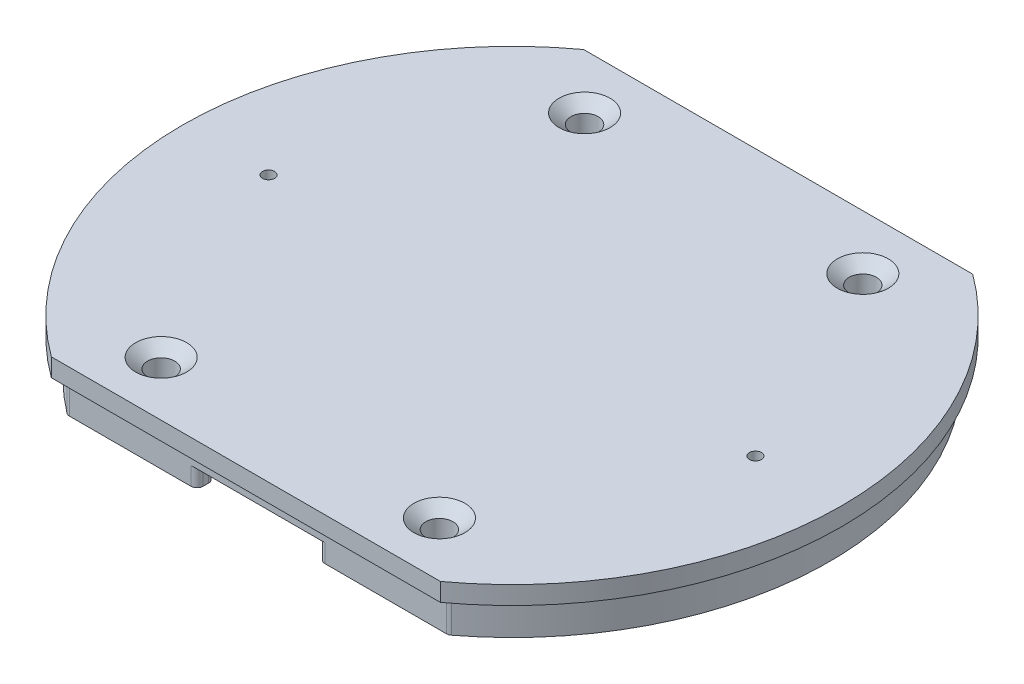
ISO-10303-21;
HEADER;
FILE_DESCRIPTION(('STEP AP214'),'2;1');
FILE_NAME('part.step','',(''),(''),'','','');
FILE_SCHEMA(('AUTOMOTIVE_DESIGN { 1 0 10303 214 1 1 1 1 }'));
ENDSEC;
DATA;
#1=APPLICATION_CONTEXT('core data for automotive mechanical design processes');
#2=APPLICATION_PROTOCOL_DEFINITION('international standard','automotive_design',2000,#1);
#3=PRODUCT_CONTEXT('',#1,'mechanical');
#4=PRODUCT('Part','Part','',(#3));
#5=PRODUCT_RELATED_PRODUCT_CATEGORY('part','',(#4));
#6=PRODUCT_DEFINITION_FORMATION('','',#4);
#7=PRODUCT_DEFINITION_CONTEXT('part definition',#1,'design');
#8=PRODUCT_DEFINITION('design','',#6,#7);
#9=PRODUCT_DEFINITION_SHAPE('','',#8);
#10=(LENGTH_UNIT() NAMED_UNIT(*) SI_UNIT(.MILLI.,.METRE.));
#11=(NAMED_UNIT(*) PLANE_ANGLE_UNIT() SI_UNIT($,.RADIAN.));
#12=(NAMED_UNIT(*) SI_UNIT($,.STERADIAN.) SOLID_ANGLE_UNIT());
#13=UNCERTAINTY_MEASURE_WITH_UNIT(LENGTH_MEASURE(1.E-05),#10,'distance_accuracy_value','');
#14=(GEOMETRIC_REPRESENTATION_CONTEXT(3) GLOBAL_UNCERTAINTY_ASSIGNED_CONTEXT((#13)) GLOBAL_UNIT_ASSIGNED_CONTEXT((#10,
#11,#12)) REPRESENTATION_CONTEXT('',''));
#15=CARTESIAN_POINT('',(0.,0.,0.));
#16=DIRECTION('',(0.,0.,1.));
#17=DIRECTION('',(1.,0.,0.));
#18=AXIS2_PLACEMENT_3D('',#15,#16,#17);
#19=CARTESIAN_POINT('',(0.,-6.,0.));
#20=DIRECTION('',(0.,-1.,0.));
#21=DIRECTION('',(0.,0.,-1.));
#22=AXIS2_PLACEMENT_3D('',#19,#20,#21);
#23=PLANE('',#22);
#24=DIRECTION('',(-1.,0.,0.));
#25=VECTOR('',#24,1.);
#26=CARTESIAN_POINT('',(31.5,-6.,42.));
#27=LINE('',#26,#25);
#28=CARTESIAN_POINT('',(-11.075,-6.,42.));
#29=VERTEX_POINT('',#28);
#30=CARTESIAN_POINT('',(-31.1648840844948,-6.,42.));
#31=VERTEX_POINT('',#30);
#32=EDGE_CURVE('E375',#29,#31,#27,.T.);
#33=ORIENTED_EDGE('',*,*,#32,.T.);
#34=CARTESIAN_POINT('',(-31.1648840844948,-6.,41.));
#35=DIRECTION('',(0.,-1.,0.));
#36=DIRECTION('',(0.,0.,-1.));
#37=AXIS2_PLACEMENT_3D('',#34,#35,#36);
#38=CIRCLE('',#37,1.);
#39=CARTESIAN_POINT('',(-31.7700274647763,-6.,41.7961165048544));
#40=VERTEX_POINT('',#39);
#41=EDGE_CURVE('E575',#31,#40,#38,.T.);
#42=ORIENTED_EDGE('',*,*,#41,.T.);
#43=CARTESIAN_POINT('',(0.,-6.,0.));
#44=DIRECTION('',(0.,-1.,0.));
#45=DIRECTION('',(0.,0.,-1.));
#46=AXIS2_PLACEMENT_3D('',#43,#44,#45);
#47=CIRCLE('',#46,52.5);
#48=CARTESIAN_POINT('',(-31.7700274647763,-6.,-41.7961165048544));
#49=VERTEX_POINT('',#48);
#50=EDGE_CURVE('E334',#40,#49,#47,.T.);
#51=ORIENTED_EDGE('',*,*,#50,.T.);
#52=CARTESIAN_POINT('',(-31.1648840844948,-6.,-41.));
#53=DIRECTION('',(0.,-1.,0.));
#54=DIRECTION('',(0.,0.,-1.));
#55=AXIS2_PLACEMENT_3D('',#52,#53,#54);
#56=CIRCLE('',#55,1.);
#57=CARTESIAN_POINT('',(-31.1648840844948,-6.,-42.));
#58=VERTEX_POINT('',#57);
#59=EDGE_CURVE('E573',#49,#58,#56,.T.);
#60=ORIENTED_EDGE('',*,*,#59,.T.);
#61=DIRECTION('',(1.,0.,0.));
#62=VECTOR('',#61,1.);
#63=CARTESIAN_POINT('',(-31.5,-6.,-42.));
#64=LINE('',#63,#62);
#65=CARTESIAN_POINT('',(-11.075,-6.,-42.));
#66=VERTEX_POINT('',#65);
#67=EDGE_CURVE('E370',#58,#66,#64,.T.);
#68=ORIENTED_EDGE('',*,*,#67,.T.);
#69=CARTESIAN_POINT('',(-11.075,-6.,-41.));
#70=DIRECTION('',(0.,-1.,0.));
#71=DIRECTION('',(0.,0.,-1.));
#72=AXIS2_PLACEMENT_3D('',#69,#70,#71);
#73=CIRCLE('',#72,1.);
#74=CARTESIAN_POINT('',(-10.075,-6.,-41.));
#75=VERTEX_POINT('',#74);
#76=EDGE_CURVE('E571',#66,#75,#73,.T.);
#77=ORIENTED_EDGE('',*,*,#76,.T.);
#78=DIRECTION('',(0.,0.,-1.));
#79=VECTOR('',#78,1.);
#80=CARTESIAN_POINT('',(-10.075,-6.,-42.));
#81=LINE('',#80,#79);
#82=CARTESIAN_POINT('',(-10.075,-6.,-40.075));
#83=VERTEX_POINT('',#82);
#84=EDGE_CURVE('E671',#83,#75,#81,.T.);
#85=ORIENTED_EDGE('',*,*,#84,.F.);
#86=CARTESIAN_POINT('',(-11.075,-6.,-40.075));
#87=DIRECTION('',(0.,-1.,0.));
#88=DIRECTION('',(0.,0.,-1.));
#89=AXIS2_PLACEMENT_3D('',#86,#87,#88);
#90=CIRCLE('',#89,1.);
#91=CARTESIAN_POINT('',(-11.075,-6.,-39.075));
#92=VERTEX_POINT('',#91);
#93=EDGE_CURVE('E569',#83,#92,#90,.T.);
#94=ORIENTED_EDGE('',*,*,#93,.T.);
#95=DIRECTION('',(1.,0.,0.));
#96=VECTOR('',#95,1.);
#97=CARTESIAN_POINT('',(-30.5094247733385,-6.,-39.075));
#98=LINE('',#97,#96);
#99=CARTESIAN_POINT('',(-30.5094247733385,-6.,-39.075));
#100=VERTEX_POINT('',#99);
#101=EDGE_CURVE('E348',#100,#92,#98,.T.);
#102=ORIENTED_EDGE('',*,*,#101,.F.);
#103=CARTESIAN_POINT('',(0.,-6.,0.));
#104=DIRECTION('',(0.,-1.,0.));
#105=DIRECTION('',(0.,0.,-1.));
#106=AXIS2_PLACEMENT_3D('',#103,#104,#105);
#107=CIRCLE('',#106,49.575);
#108=CARTESIAN_POINT('',(-30.5094247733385,-6.,39.075));
#109=VERTEX_POINT('',#108);
#110=EDGE_CURVE('E341',#109,#100,#107,.T.);
#111=ORIENTED_EDGE('',*,*,#110,.F.);
#112=DIRECTION('',(-1.,0.,0.));
#113=VECTOR('',#112,1.);
#114=CARTESIAN_POINT('',(30.5094247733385,-6.,39.075));
#115=LINE('',#114,#113);
#116=CARTESIAN_POINT('',(-11.075,-6.,39.075));
#117=VERTEX_POINT('',#116);
#118=EDGE_CURVE('E323',#117,#109,#115,.T.);
#119=ORIENTED_EDGE('',*,*,#118,.F.);
#120=CARTESIAN_POINT('',(-11.075,-6.,40.075));
#121=DIRECTION('',(0.,-1.,0.));
#122=DIRECTION('',(0.,0.,-1.));
#123=AXIS2_PLACEMENT_3D('',#120,#121,#122);
#124=CIRCLE('',#123,1.);
#125=CARTESIAN_POINT('',(-10.075,-6.,40.075));
#126=VERTEX_POINT('',#125);
#127=EDGE_CURVE('E567',#117,#126,#124,.T.);
#128=ORIENTED_EDGE('',*,*,#127,.T.);
#129=DIRECTION('',(0.,0.,-1.));
#130=VECTOR('',#129,1.);
#131=CARTESIAN_POINT('',(-10.075,-6.,42.));
#132=LINE('',#131,#130);
#133=CARTESIAN_POINT('',(-10.075,-6.,41.));
#134=VERTEX_POINT('',#133);
#135=EDGE_CURVE('E653',#134,#126,#132,.T.);
#136=ORIENTED_EDGE('',*,*,#135,.F.);
#137=CARTESIAN_POINT('',(-11.075,-6.,41.));
#138=DIRECTION('',(0.,-1.,0.));
#139=DIRECTION('',(0.,0.,-1.));
#140=AXIS2_PLACEMENT_3D('',#137,#138,#139);
#141=CIRCLE('',#140,1.);
#142=EDGE_CURVE('E565',#134,#29,#141,.T.);
#143=ORIENTED_EDGE('',*,*,#142,.T.);
#144=EDGE_LOOP('',(#33,#42,#51,#60,#68,#77,#85,#94,#102,#111,#119,#128,#136,#143));
#145=FACE_BOUND('',#144,.T.);
#146=ADVANCED_FACE('F32',(#145),#23,.T.);
#147=CARTESIAN_POINT('',(-30.5094247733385,-6.,-39.075));
#148=DIRECTION('',(0.,0.,1.));
#149=DIRECTION('',(1.,0.,0.));
#150=AXIS2_PLACEMENT_3D('',#147,#148,#149);
#151=PLANE('',#150);
#152=ORIENTED_EDGE('',*,*,#101,.T.);
#153=DIRECTION('',(0.,-1.,0.));
#154=VECTOR('',#153,1.);
#155=CARTESIAN_POINT('',(-11.075,-3.,-39.075));
#156=LINE('',#155,#154);
#157=CARTESIAN_POINT('',(-11.075,-3.,-39.075));
#158=VERTEX_POINT('',#157);
#159=EDGE_CURVE('E601',#92,#158,#156,.F.);
#160=ORIENTED_EDGE('',*,*,#159,.T.);
#161=DIRECTION('',(1.,0.,0.));
#162=VECTOR('',#161,1.);
#163=CARTESIAN_POINT('',(-30.5094247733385,-3.,-39.075));
#164=LINE('',#163,#162);
#165=CARTESIAN_POINT('',(-30.5094247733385,-3.,-39.075));
#166=VERTEX_POINT('',#165);
#167=EDGE_CURVE('E324',#166,#158,#164,.T.);
#168=ORIENTED_EDGE('',*,*,#167,.F.);
#169=DIRECTION('',(0.,1.,0.));
#170=VECTOR('',#169,1.);
#171=CARTESIAN_POINT('',(-30.5094247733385,-6.,-39.075));
#172=LINE('',#171,#170);
#173=EDGE_CURVE('E362',#100,#166,#172,.T.);
#174=ORIENTED_EDGE('',*,*,#173,.F.);
#175=EDGE_LOOP('',(#152,#160,#168,#174));
#176=FACE_BOUND('',#175,.T.);
#177=ADVANCED_FACE('F754',(#176),#151,.T.);
#178=CARTESIAN_POINT('',(30.5094247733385,-6.,39.075));
#179=DIRECTION('',(0.,0.,-1.));
#180=DIRECTION('',(-1.,0.,0.));
#181=AXIS2_PLACEMENT_3D('',#178,#179,#180);
#182=PLANE('',#181);
#183=DIRECTION('',(-1.,0.,0.));
#184=VECTOR('',#183,1.);
#185=CARTESIAN_POINT('',(30.5094247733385,-3.,39.075));
#186=LINE('',#185,#184);
#187=CARTESIAN_POINT('',(-11.075,-3.,39.075));
#188=VERTEX_POINT('',#187);
#189=CARTESIAN_POINT('',(-30.5094247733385,-3.,39.075));
#190=VERTEX_POINT('',#189);
#191=EDGE_CURVE('E353',#188,#190,#186,.T.);
#192=ORIENTED_EDGE('',*,*,#191,.F.);
#193=DIRECTION('',(0.,-1.,0.));
#194=VECTOR('',#193,1.);
#195=CARTESIAN_POINT('',(-11.075,-6.,39.075));
#196=LINE('',#195,#194);
#197=EDGE_CURVE('E610',#188,#117,#196,.T.);
#198=ORIENTED_EDGE('',*,*,#197,.T.);
#199=ORIENTED_EDGE('',*,*,#118,.T.);
#200=DIRECTION('',(0.,1.,0.));
#201=VECTOR('',#200,1.);
#202=CARTESIAN_POINT('',(-30.5094247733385,-6.,39.075));
#203=LINE('',#202,#201);
#204=EDGE_CURVE('E335',#109,#190,#203,.T.);
#205=ORIENTED_EDGE('',*,*,#204,.T.);
#206=EDGE_LOOP('',(#192,#198,#199,#205));
#207=FACE_BOUND('',#206,.T.);
#208=ADVANCED_FACE('F645',(#207),#182,.T.);
#209=CARTESIAN_POINT('',(0.,3.,0.));
#210=DIRECTION('',(0.,-1.,0.));
#211=DIRECTION('',(0.,0.,-1.));
#212=AXIS2_PLACEMENT_3D('',#209,#210,#211);
#213=CYLINDRICAL_SURFACE('',#212,52.5);
#214=CARTESIAN_POINT('',(0.,0.,0.));
#215=DIRECTION('',(0.,1.,0.));
#216=DIRECTION('',(0.,0.,1.));
#217=AXIS2_PLACEMENT_3D('',#214,#215,#216);
#218=CIRCLE('',#217,52.5);
#219=CARTESIAN_POINT('',(31.7700274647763,0.,41.7961165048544));
#220=VERTEX_POINT('',#219);
#221=CARTESIAN_POINT('',(31.7700274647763,0.,-41.7961165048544));
#222=VERTEX_POINT('',#221);
#223=EDGE_CURVE('E385',#220,#222,#218,.T.);
#224=ORIENTED_EDGE('',*,*,#223,.F.);
#225=DIRECTION('',(0.,-1.,0.));
#226=VECTOR('',#225,1.);
#227=CARTESIAN_POINT('',(31.7700274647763,3.,41.7961165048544));
#228=LINE('',#227,#226);
#229=CARTESIAN_POINT('',(31.7700274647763,-6.,41.7961165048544));
#230=VERTEX_POINT('',#229);
#231=EDGE_CURVE('E547',#220,#230,#228,.T.);
#232=ORIENTED_EDGE('',*,*,#231,.T.);
#233=CARTESIAN_POINT('',(0.,-6.,0.));
#234=DIRECTION('',(0.,-1.,0.));
#235=DIRECTION('',(0.,0.,-1.));
#236=AXIS2_PLACEMENT_3D('',#233,#234,#235);
#237=CIRCLE('',#236,52.5);
#238=CARTESIAN_POINT('',(31.7700274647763,-6.,-41.7961165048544));
#239=VERTEX_POINT('',#238);
#240=EDGE_CURVE('E373',#239,#230,#237,.T.);
#241=ORIENTED_EDGE('',*,*,#240,.F.);
#242=DIRECTION('',(0.,-1.,0.));
#243=VECTOR('',#242,1.);
#244=CARTESIAN_POINT('',(31.7700274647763,3.,-41.7961165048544));
#245=LINE('',#244,#243);
#246=EDGE_CURVE('E544',#239,#222,#245,.F.);
#247=ORIENTED_EDGE('',*,*,#246,.T.);
#248=EDGE_LOOP('',(#224,#232,#241,#247));
#249=FACE_BOUND('',#248,.T.);
#250=ADVANCED_FACE('F996',(#249),#213,.T.);
#251=ORIENTED_EDGE('',*,*,#50,.F.);
#252=DIRECTION('',(0.,-1.,0.));
#253=VECTOR('',#252,1.);
#254=CARTESIAN_POINT('',(-31.7700274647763,3.,41.7961165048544));
#255=LINE('',#254,#253);
#256=CARTESIAN_POINT('',(-31.7700274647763,0.,41.7961165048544));
#257=VERTEX_POINT('',#256);
#258=EDGE_CURVE('E562',#40,#257,#255,.F.);
#259=ORIENTED_EDGE('',*,*,#258,.T.);
#260=CARTESIAN_POINT('',(0.,0.,0.));
#261=DIRECTION('',(0.,1.,0.));
#262=DIRECTION('',(0.,0.,1.));
#263=AXIS2_PLACEMENT_3D('',#260,#261,#262);
#264=CIRCLE('',#263,52.5);
#265=CARTESIAN_POINT('',(-31.7700274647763,0.,-41.7961165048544));
#266=VERTEX_POINT('',#265);
#267=EDGE_CURVE('E379',#266,#257,#264,.T.);
#268=ORIENTED_EDGE('',*,*,#267,.F.);
#269=DIRECTION('',(0.,-1.,0.));
#270=VECTOR('',#269,1.);
#271=CARTESIAN_POINT('',(-31.7700274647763,3.,-41.7961165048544));
#272=LINE('',#271,#270);
#273=EDGE_CURVE('E560',#266,#49,#272,.T.);
#274=ORIENTED_EDGE('',*,*,#273,.T.);
#275=EDGE_LOOP('',(#251,#259,#268,#274));
#276=FACE_BOUND('',#275,.T.);
#277=ADVANCED_FACE('F985',(#276),#213,.T.);
#278=CARTESIAN_POINT('',(-31.5,0.,-42.));
#279=DIRECTION('',(0.,0.,1.));
#280=DIRECTION('',(1.,0.,0.));
#281=AXIS2_PLACEMENT_3D('',#278,#279,#280);
#282=PLANE('',#281);
#283=DIRECTION('',(-1.,0.,0.));
#284=VECTOR('',#283,1.);
#285=CARTESIAN_POINT('',(31.5,0.,-42.));
#286=LINE('',#285,#284);
#287=CARTESIAN_POINT('',(31.1648840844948,0.,-42.));
#288=VERTEX_POINT('',#287);
#289=CARTESIAN_POINT('',(-31.1648840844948,0.,-42.));
#290=VERTEX_POINT('',#289);
#291=EDGE_CURVE('E388',#288,#290,#286,.T.);
#292=ORIENTED_EDGE('',*,*,#291,.F.);
#293=DIRECTION('',(0.,-1.,0.));
#294=VECTOR('',#293,1.);
#295=CARTESIAN_POINT('',(31.1648840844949,0.,-42.));
#296=LINE('',#295,#294);
#297=CARTESIAN_POINT('',(31.1648840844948,-6.,-42.));
#298=VERTEX_POINT('',#297);
#299=EDGE_CURVE('E586',#288,#298,#296,.T.);
#300=ORIENTED_EDGE('',*,*,#299,.T.);
#301=CARTESIAN_POINT('',(11.075,-6.,-42.));
#302=VERTEX_POINT('',#301);
#303=EDGE_CURVE('E369',#302,#298,#64,.T.);
#304=ORIENTED_EDGE('',*,*,#303,.F.);
#305=DIRECTION('',(0.,-1.,0.));
#306=VECTOR('',#305,1.);
#307=CARTESIAN_POINT('',(11.075,0.,-42.));
#308=LINE('',#307,#306);
#309=CARTESIAN_POINT('',(11.075,-3.,-42.));
#310=VERTEX_POINT('',#309);
#311=EDGE_CURVE('E580',#302,#310,#308,.F.);
#312=ORIENTED_EDGE('',*,*,#311,.T.);
#313=DIRECTION('',(-1.,0.,0.));
#314=VECTOR('',#313,1.);
#315=CARTESIAN_POINT('',(-10.075,-3.,-42.));
#316=LINE('',#315,#314);
#317=CARTESIAN_POINT('',(-11.075,-3.,-42.));
#318=VERTEX_POINT('',#317);
#319=EDGE_CURVE('E663',#310,#318,#316,.T.);
#320=ORIENTED_EDGE('',*,*,#319,.T.);
#321=DIRECTION('',(0.,-1.,0.));
#322=VECTOR('',#321,1.);
#323=CARTESIAN_POINT('',(-11.075,0.,-42.));
#324=LINE('',#323,#322);
#325=EDGE_CURVE('E577',#318,#66,#324,.T.);
#326=ORIENTED_EDGE('',*,*,#325,.T.);
#327=ORIENTED_EDGE('',*,*,#67,.F.);
#328=DIRECTION('',(0.,-1.,0.));
#329=VECTOR('',#328,1.);
#330=CARTESIAN_POINT('',(-31.1648840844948,0.,-42.));
#331=LINE('',#330,#329);
#332=EDGE_CURVE('E583',#58,#290,#331,.F.);
#333=ORIENTED_EDGE('',*,*,#332,.T.);
#334=EDGE_LOOP('',(#292,#300,#304,#312,#320,#326,#327,#333));
#335=FACE_BOUND('',#334,.T.);
#336=ADVANCED_FACE('F973',(#335),#282,.F.);
#337=CARTESIAN_POINT('',(-31.5,0.,42.));
#338=DIRECTION('',(0.,0.,-1.));
#339=DIRECTION('',(-1.,0.,0.));
#340=AXIS2_PLACEMENT_3D('',#337,#338,#339);
#341=PLANE('',#340);
#342=CARTESIAN_POINT('',(31.1648840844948,-6.,42.));
#343=VERTEX_POINT('',#342);
#344=CARTESIAN_POINT('',(11.075,-6.,42.));
#345=VERTEX_POINT('',#344);
#346=EDGE_CURVE('E376',#343,#345,#27,.T.);
#347=ORIENTED_EDGE('',*,*,#346,.F.);
#348=DIRECTION('',(0.,-1.,0.));
#349=VECTOR('',#348,1.);
#350=CARTESIAN_POINT('',(31.1648840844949,0.,42.));
#351=LINE('',#350,#349);
#352=CARTESIAN_POINT('',(31.1648840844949,0.,42.));
#353=VERTEX_POINT('',#352);
#354=EDGE_CURVE('E541',#343,#353,#351,.F.);
#355=ORIENTED_EDGE('',*,*,#354,.T.);
#356=DIRECTION('',(1.,0.,0.));
#357=VECTOR('',#356,1.);
#358=CARTESIAN_POINT('',(-31.5,0.,42.));
#359=LINE('',#358,#357);
#360=CARTESIAN_POINT('',(-31.1648840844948,0.,42.));
#361=VERTEX_POINT('',#360);
#362=EDGE_CURVE('E382',#361,#353,#359,.T.);
#363=ORIENTED_EDGE('',*,*,#362,.F.);
#364=DIRECTION('',(0.,-1.,0.));
#365=VECTOR('',#364,1.);
#366=CARTESIAN_POINT('',(-31.1648840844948,0.,42.));
#367=LINE('',#366,#365);
#368=EDGE_CURVE('E539',#361,#31,#367,.T.);
#369=ORIENTED_EDGE('',*,*,#368,.T.);
#370=ORIENTED_EDGE('',*,*,#32,.F.);
#371=DIRECTION('',(0.,-1.,0.));
#372=VECTOR('',#371,1.);
#373=CARTESIAN_POINT('',(-11.075,0.,42.));
#374=LINE('',#373,#372);
#375=CARTESIAN_POINT('',(-11.075,-3.,42.));
#376=VERTEX_POINT('',#375);
#377=EDGE_CURVE('E533',#29,#376,#374,.F.);
#378=ORIENTED_EDGE('',*,*,#377,.T.);
#379=DIRECTION('',(1.,0.,0.));
#380=VECTOR('',#379,1.);
#381=CARTESIAN_POINT('',(-10.075,-3.,42.));
#382=LINE('',#381,#380);
#383=CARTESIAN_POINT('',(11.075,-3.,42.));
#384=VERTEX_POINT('',#383);
#385=EDGE_CURVE('E667',#376,#384,#382,.T.);
#386=ORIENTED_EDGE('',*,*,#385,.T.);
#387=DIRECTION('',(0.,-1.,0.));
#388=VECTOR('',#387,1.);
#389=CARTESIAN_POINT('',(11.075,0.,42.));
#390=LINE('',#389,#388);
#391=EDGE_CURVE('E536',#384,#345,#390,.T.);
#392=ORIENTED_EDGE('',*,*,#391,.T.);
#393=EDGE_LOOP('',(#347,#355,#363,#369,#370,#378,#386,#392));
#394=FACE_BOUND('',#393,.T.);
#395=ADVANCED_FACE('F969',(#394),#341,.F.);
#396=CARTESIAN_POINT('',(0.,0.,0.));
#397=DIRECTION('',(0.,1.,0.));
#398=DIRECTION('',(0.,0.,1.));
#399=AXIS2_PLACEMENT_3D('',#396,#397,#398);
#400=PLANE('',#399);
#401=CARTESIAN_POINT('',(-23.,0.,-35.));
#402=DIRECTION('',(0.,1.,0.));
#403=DIRECTION('',(0.,0.,1.));
#404=AXIS2_PLACEMENT_3D('',#401,#402,#403);
#405=CIRCLE('',#404,5.2479);
#406=CARTESIAN_POINT('',(-17.8482571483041,0.,-36.));
#407=VERTEX_POINT('',#406);
#408=CARTESIAN_POINT('',(-28.1517428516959,0.,-36.));
#409=VERTEX_POINT('',#408);
#410=EDGE_CURVE('E518',#407,#409,#405,.F.);
#411=ORIENTED_EDGE('',*,*,#410,.F.);
#412=DIRECTION('',(1.,0.,0.));
#413=VECTOR('',#412,1.);
#414=CARTESIAN_POINT('',(-29.4321253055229,0.,-36.));
#415=LINE('',#414,#413);
#416=CARTESIAN_POINT('',(17.8482571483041,0.,-36.));
#417=VERTEX_POINT('',#416);
#418=EDGE_CURVE('E449',#407,#417,#415,.T.);
#419=ORIENTED_EDGE('',*,*,#418,.T.);
#420=CARTESIAN_POINT('',(23.,0.,-35.));
#421=DIRECTION('',(0.,1.,0.));
#422=DIRECTION('',(0.,0.,1.));
#423=AXIS2_PLACEMENT_3D('',#420,#421,#422);
#424=CIRCLE('',#423,5.2479);
#425=CARTESIAN_POINT('',(28.1517428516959,0.,-36.));
#426=VERTEX_POINT('',#425);
#427=EDGE_CURVE('E515',#426,#417,#424,.F.);
#428=ORIENTED_EDGE('',*,*,#427,.F.);
#429=CARTESIAN_POINT('',(29.4321253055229,0.,-36.));
#430=VERTEX_POINT('',#429);
#431=EDGE_CURVE('E444',#426,#430,#415,.T.);
#432=ORIENTED_EDGE('',*,*,#431,.T.);
#433=CARTESIAN_POINT('',(0.,0.,0.));
#434=DIRECTION('',(0.,-1.,0.));
#435=DIRECTION('',(0.,0.,-1.));
#436=AXIS2_PLACEMENT_3D('',#433,#434,#435);
#437=CIRCLE('',#436,46.5);
#438=CARTESIAN_POINT('',(29.4321253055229,0.,36.));
#439=VERTEX_POINT('',#438);
#440=EDGE_CURVE('E433',#430,#439,#437,.T.);
#441=ORIENTED_EDGE('',*,*,#440,.T.);
#442=DIRECTION('',(-1.,0.,0.));
#443=VECTOR('',#442,1.);
#444=CARTESIAN_POINT('',(29.4321253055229,0.,36.));
#445=LINE('',#444,#443);
#446=CARTESIAN_POINT('',(28.1517428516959,0.,36.));
#447=VERTEX_POINT('',#446);
#448=EDGE_CURVE('E437',#439,#447,#445,.T.);
#449=ORIENTED_EDGE('',*,*,#448,.T.);
#450=CARTESIAN_POINT('',(23.,0.,35.));
#451=DIRECTION('',(0.,1.,0.));
#452=DIRECTION('',(0.,0.,1.));
#453=AXIS2_PLACEMENT_3D('',#450,#451,#452);
#454=CIRCLE('',#453,5.2479);
#455=CARTESIAN_POINT('',(17.8482571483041,0.,36.));
#456=VERTEX_POINT('',#455);
#457=EDGE_CURVE('E512',#456,#447,#454,.F.);
#458=ORIENTED_EDGE('',*,*,#457,.F.);
#459=CARTESIAN_POINT('',(-17.8482571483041,0.,36.));
#460=VERTEX_POINT('',#459);
#461=EDGE_CURVE('E441',#456,#460,#445,.T.);
#462=ORIENTED_EDGE('',*,*,#461,.T.);
#463=CARTESIAN_POINT('',(-23.,0.,35.));
#464=DIRECTION('',(0.,1.,0.));
#465=DIRECTION('',(0.,0.,1.));
#466=AXIS2_PLACEMENT_3D('',#463,#464,#465);
#467=CIRCLE('',#466,5.2479);
#468=CARTESIAN_POINT('',(-28.1517428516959,0.,36.));
#469=VERTEX_POINT('',#468);
#470=EDGE_CURVE('E507',#469,#460,#467,.F.);
#471=ORIENTED_EDGE('',*,*,#470,.F.);
#472=CARTESIAN_POINT('',(-29.4321253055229,0.,36.));
#473=VERTEX_POINT('',#472);
#474=EDGE_CURVE('E436',#469,#473,#445,.T.);
#475=ORIENTED_EDGE('',*,*,#474,.T.);
#476=CARTESIAN_POINT('',(0.,0.,0.));
#477=DIRECTION('',(0.,-1.,0.));
#478=DIRECTION('',(0.,0.,-1.));
#479=AXIS2_PLACEMENT_3D('',#476,#477,#478);
#480=CIRCLE('',#479,46.5);
#481=CARTESIAN_POINT('',(-29.4321253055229,0.,-36.));
#482=VERTEX_POINT('',#481);
#483=EDGE_CURVE('E440',#473,#482,#480,.T.);
#484=ORIENTED_EDGE('',*,*,#483,.T.);
#485=EDGE_CURVE('E445',#482,#409,#415,.T.);
#486=ORIENTED_EDGE('',*,*,#485,.T.);
#487=EDGE_LOOP('',(#411,#419,#428,#432,#441,#449,#458,#462,#471,#475,#484,#486));
#488=FACE_BOUND('',#487,.T.);
#489=CARTESIAN_POINT('',(40.25,0.,0.));
#490=DIRECTION('',(0.,1.,0.));
#491=DIRECTION('',(0.,0.,-1.));
#492=AXIS2_PLACEMENT_3D('',#489,#490,#491);
#493=CIRCLE('',#492,0.999999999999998);
#494=CARTESIAN_POINT('',(40.25,0.,-0.999999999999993));
#495=VERTEX_POINT('',#494);
#496=EDGE_CURVE('E497',#495,#495,#493,.T.);
#497=ORIENTED_EDGE('',*,*,#496,.T.);
#498=EDGE_LOOP('',(#497));
#499=FACE_BOUND('',#498,.T.);
#500=CARTESIAN_POINT('',(-40.25,0.,0.));
#501=DIRECTION('',(0.,1.,0.));
#502=DIRECTION('',(0.,0.,1.));
#503=AXIS2_PLACEMENT_3D('',#500,#501,#502);
#504=CIRCLE('',#503,0.999999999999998);
#505=CARTESIAN_POINT('',(-40.25,0.,1.));
#506=VERTEX_POINT('',#505);
#507=EDGE_CURVE('E501',#506,#506,#504,.T.);
#508=ORIENTED_EDGE('',*,*,#507,.T.);
#509=EDGE_LOOP('',(#508));
#510=FACE_BOUND('',#509,.T.);
#511=ADVANCED_FACE('F713',(#488,#499,#510),#400,.F.);
#512=CARTESIAN_POINT('',(0.,3.,0.));
#513=DIRECTION('',(0.,1.,0.));
#514=DIRECTION('',(0.,0.,1.));
#515=AXIS2_PLACEMENT_3D('',#512,#513,#514);
#516=PLANE('',#515);
#517=CARTESIAN_POINT('',(-23.,3.,-35.));
#518=DIRECTION('',(0.,1.,0.));
#519=DIRECTION('',(0.,0.,1.));
#520=AXIS2_PLACEMENT_3D('',#517,#518,#519);
#521=CIRCLE('',#520,4.2164);
#522=CARTESIAN_POINT('',(-23.,3.,-30.7836));
#523=VERTEX_POINT('',#522);
#524=EDGE_CURVE('E702',#523,#523,#521,.T.);
#525=ORIENTED_EDGE('',*,*,#524,.F.);
#526=EDGE_LOOP('',(#525));
#527=FACE_BOUND('',#526,.T.);
#528=CARTESIAN_POINT('',(23.,3.,-35.));
#529=DIRECTION('',(0.,1.,0.));
#530=DIRECTION('',(0.,0.,1.));
#531=AXIS2_PLACEMENT_3D('',#528,#529,#530);
#532=CIRCLE('',#531,4.2164);
#533=CARTESIAN_POINT('',(23.,3.,-30.7836));
#534=VERTEX_POINT('',#533);
#535=EDGE_CURVE('E696',#534,#534,#532,.T.);
#536=ORIENTED_EDGE('',*,*,#535,.F.);
#537=EDGE_LOOP('',(#536));
#538=FACE_BOUND('',#537,.T.);
#539=CARTESIAN_POINT('',(23.,3.,35.));
#540=DIRECTION('',(0.,1.,0.));
#541=DIRECTION('',(0.,0.,1.));
#542=AXIS2_PLACEMENT_3D('',#539,#540,#541);
#543=CIRCLE('',#542,4.2164);
#544=CARTESIAN_POINT('',(23.,3.,39.2164));
#545=VERTEX_POINT('',#544);
#546=EDGE_CURVE('E690',#545,#545,#543,.T.);
#547=ORIENTED_EDGE('',*,*,#546,.F.);
#548=EDGE_LOOP('',(#547));
#549=FACE_BOUND('',#548,.T.);
#550=CARTESIAN_POINT('',(-23.,3.,35.));
#551=DIRECTION('',(0.,1.,0.));
#552=DIRECTION('',(0.,0.,1.));
#553=AXIS2_PLACEMENT_3D('',#550,#551,#552);
#554=CIRCLE('',#553,4.2164);
#555=CARTESIAN_POINT('',(-23.,3.,39.2164));
#556=VERTEX_POINT('',#555);
#557=EDGE_CURVE('E684',#556,#556,#554,.T.);
#558=ORIENTED_EDGE('',*,*,#557,.F.);
#559=EDGE_LOOP('',(#558));
#560=FACE_BOUND('',#559,.T.);
#561=CARTESIAN_POINT('',(40.25,3.,0.));
#562=DIRECTION('',(0.,1.,0.));
#563=DIRECTION('',(0.,0.,-1.));
#564=AXIS2_PLACEMENT_3D('',#561,#562,#563);
#565=CIRCLE('',#564,0.999999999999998);
#566=CARTESIAN_POINT('',(40.25,3.,-0.999999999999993));
#567=VERTEX_POINT('',#566);
#568=EDGE_CURVE('E498',#567,#567,#565,.T.);
#569=ORIENTED_EDGE('',*,*,#568,.F.);
#570=EDGE_LOOP('',(#569));
#571=FACE_BOUND('',#570,.T.);
#572=CARTESIAN_POINT('',(-40.25,3.,0.));
#573=DIRECTION('',(0.,1.,0.));
#574=DIRECTION('',(0.,0.,1.));
#575=AXIS2_PLACEMENT_3D('',#572,#573,#574);
#576=CIRCLE('',#575,0.999999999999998);
#577=CARTESIAN_POINT('',(-40.25,3.,1.));
#578=VERTEX_POINT('',#577);
#579=EDGE_CURVE('E504',#578,#578,#576,.T.);
#580=ORIENTED_EDGE('',*,*,#579,.F.);
#581=EDGE_LOOP('',(#580));
#582=FACE_BOUND('',#581,.T.);
#583=CARTESIAN_POINT('',(0.,3.,0.));
#584=DIRECTION('',(0.,1.,0.));
#585=DIRECTION('',(0.,0.,1.));
#586=AXIS2_PLACEMENT_3D('',#583,#584,#585);
#587=CIRCLE('',#586,54.5);
#588=CARTESIAN_POINT('',(-32.159757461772,3.,-44.));
#589=VERTEX_POINT('',#588);
#590=CARTESIAN_POINT('',(-32.159757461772,3.,44.));
#591=VERTEX_POINT('',#590);
#592=EDGE_CURVE('E391',#589,#591,#587,.T.);
#593=ORIENTED_EDGE('',*,*,#592,.T.);
#594=DIRECTION('',(1.,0.,0.));
#595=VECTOR('',#594,1.);
#596=CARTESIAN_POINT('',(-32.159757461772,3.,44.));
#597=LINE('',#596,#595);
#598=CARTESIAN_POINT('',(32.159757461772,3.,44.));
#599=VERTEX_POINT('',#598);
#600=EDGE_CURVE('E408',#591,#599,#597,.T.);
#601=ORIENTED_EDGE('',*,*,#600,.T.);
#602=CARTESIAN_POINT('',(0.,3.,0.));
#603=DIRECTION('',(0.,1.,0.));
#604=DIRECTION('',(0.,0.,1.));
#605=AXIS2_PLACEMENT_3D('',#602,#603,#604);
#606=CIRCLE('',#605,54.5);
#607=CARTESIAN_POINT('',(32.159757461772,3.,-44.));
#608=VERTEX_POINT('',#607);
#609=EDGE_CURVE('E411',#599,#608,#606,.T.);
#610=ORIENTED_EDGE('',*,*,#609,.T.);
#611=DIRECTION('',(-1.,0.,0.));
#612=VECTOR('',#611,1.);
#613=CARTESIAN_POINT('',(32.159757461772,3.,-44.));
#614=LINE('',#613,#612);
#615=EDGE_CURVE('E396',#608,#589,#614,.T.);
#616=ORIENTED_EDGE('',*,*,#615,.T.);
#617=EDGE_LOOP('',(#593,#601,#610,#616));
#618=FACE_BOUND('',#617,.T.);
#619=ADVANCED_FACE('F709',(#527,#538,#549,#560,#571,#582,#618),#516,.T.);
#620=CARTESIAN_POINT('',(-40.25,3.,0.));
#621=DIRECTION('',(0.,-1.,0.));
#622=DIRECTION('',(0.,0.,-1.));
#623=AXIS2_PLACEMENT_3D('',#620,#621,#622);
#624=CYLINDRICAL_SURFACE('',#623,0.999999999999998);
#625=ORIENTED_EDGE('',*,*,#579,.T.);
#626=EDGE_LOOP('',(#625));
#627=FACE_BOUND('',#626,.T.);
#628=ORIENTED_EDGE('',*,*,#507,.F.);
#629=EDGE_LOOP('',(#628));
#630=FACE_BOUND('',#629,.T.);
#631=ADVANCED_FACE('F712',(#627,#630),#624,.F.);
#632=CARTESIAN_POINT('',(40.25,3.,0.));
#633=DIRECTION('',(0.,-1.,0.));
#634=DIRECTION('',(0.,0.,-1.));
#635=AXIS2_PLACEMENT_3D('',#632,#633,#634);
#636=CYLINDRICAL_SURFACE('',#635,0.999999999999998);
#637=ORIENTED_EDGE('',*,*,#568,.T.);
#638=EDGE_LOOP('',(#637));
#639=FACE_BOUND('',#638,.T.);
#640=ORIENTED_EDGE('',*,*,#496,.F.);
#641=EDGE_LOOP('',(#640));
#642=FACE_BOUND('',#641,.T.);
#643=ADVANCED_FACE('F1179',(#639,#642),#636,.F.);
#644=CARTESIAN_POINT('',(-23.,3.,35.));
#645=DIRECTION('',(0.,1.,0.));
#646=DIRECTION('',(0.,0.,1.));
#647=AXIS2_PLACEMENT_3D('',#644,#645,#646);
#648=CYLINDRICAL_SURFACE('',#647,2.2479);
#649=CARTESIAN_POINT('',(-23.,1.34823237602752,35.));
#650=DIRECTION('',(0.,1.,0.));
#651=DIRECTION('',(0.,0.,1.));
#652=AXIS2_PLACEMENT_3D('',#649,#650,#651);
#653=CIRCLE('',#652,2.2479);
#654=CARTESIAN_POINT('',(-23.,1.34823237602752,37.2479));
#655=VERTEX_POINT('',#654);
#656=EDGE_CURVE('E678',#655,#655,#653,.T.);
#657=ORIENTED_EDGE('',*,*,#656,.T.);
#658=EDGE_LOOP('',(#657));
#659=FACE_BOUND('',#658,.T.);
#660=CARTESIAN_POINT('',(-23.,-3.,35.));
#661=DIRECTION('',(0.,-1.,0.));
#662=DIRECTION('',(0.,0.,-1.));
#663=AXIS2_PLACEMENT_3D('',#660,#661,#662);
#664=CIRCLE('',#663,2.2479);
#665=CARTESIAN_POINT('',(-23.,-3.,32.7521));
#666=VERTEX_POINT('',#665);
#667=EDGE_CURVE('E491',#666,#666,#664,.T.);
#668=ORIENTED_EDGE('',*,*,#667,.T.);
#669=EDGE_LOOP('',(#668));
#670=FACE_BOUND('',#669,.T.);
#671=ADVANCED_FACE('F1184',(#659,#670),#648,.F.);
#672=CARTESIAN_POINT('',(23.,3.,35.));
#673=DIRECTION('',(0.,1.,0.));
#674=DIRECTION('',(0.,0.,1.));
#675=AXIS2_PLACEMENT_3D('',#672,#673,#674);
#676=CYLINDRICAL_SURFACE('',#675,2.2479);
#677=CARTESIAN_POINT('',(23.,1.34823237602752,35.));
#678=DIRECTION('',(0.,1.,0.));
#679=DIRECTION('',(0.,0.,1.));
#680=AXIS2_PLACEMENT_3D('',#677,#678,#679);
#681=CIRCLE('',#680,2.2479);
#682=CARTESIAN_POINT('',(23.,1.34823237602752,37.2479));
#683=VERTEX_POINT('',#682);
#684=EDGE_CURVE('E687',#683,#683,#681,.T.);
#685=ORIENTED_EDGE('',*,*,#684,.T.);
#686=EDGE_LOOP('',(#685));
#687=FACE_BOUND('',#686,.T.);
#688=CARTESIAN_POINT('',(23.,-3.,35.));
#689=DIRECTION('',(0.,-1.,0.));
#690=DIRECTION('',(0.,0.,-1.));
#691=AXIS2_PLACEMENT_3D('',#688,#689,#690);
#692=CIRCLE('',#691,2.2479);
#693=CARTESIAN_POINT('',(23.,-3.,32.7521));
#694=VERTEX_POINT('',#693);
#695=EDGE_CURVE('E485',#694,#694,#692,.T.);
#696=ORIENTED_EDGE('',*,*,#695,.T.);
#697=EDGE_LOOP('',(#696));
#698=FACE_BOUND('',#697,.T.);
#699=ADVANCED_FACE('F1202',(#687,#698),#676,.F.);
#700=CARTESIAN_POINT('',(23.,3.,-35.));
#701=DIRECTION('',(0.,1.,0.));
#702=DIRECTION('',(0.,0.,1.));
#703=AXIS2_PLACEMENT_3D('',#700,#701,#702);
#704=CYLINDRICAL_SURFACE('',#703,2.2479);
#705=CARTESIAN_POINT('',(23.,1.34823237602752,-35.));
#706=DIRECTION('',(0.,1.,0.));
#707=DIRECTION('',(0.,0.,1.));
#708=AXIS2_PLACEMENT_3D('',#705,#706,#707);
#709=CIRCLE('',#708,2.2479);
#710=CARTESIAN_POINT('',(23.,1.34823237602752,-32.7521));
#711=VERTEX_POINT('',#710);
#712=EDGE_CURVE('E693',#711,#711,#709,.T.);
#713=ORIENTED_EDGE('',*,*,#712,.T.);
#714=EDGE_LOOP('',(#713));
#715=FACE_BOUND('',#714,.T.);
#716=CARTESIAN_POINT('',(23.,-3.,-35.));
#717=DIRECTION('',(0.,-1.,0.));
#718=DIRECTION('',(0.,0.,-1.));
#719=AXIS2_PLACEMENT_3D('',#716,#717,#718);
#720=CIRCLE('',#719,2.2479);
#721=CARTESIAN_POINT('',(23.,-3.,-37.2479));
#722=VERTEX_POINT('',#721);
#723=EDGE_CURVE('E479',#722,#722,#720,.T.);
#724=ORIENTED_EDGE('',*,*,#723,.T.);
#725=EDGE_LOOP('',(#724));
#726=FACE_BOUND('',#725,.T.);
#727=ADVANCED_FACE('F1210',(#715,#726),#704,.F.);
#728=CARTESIAN_POINT('',(-23.,3.,-35.));
#729=DIRECTION('',(0.,1.,0.));
#730=DIRECTION('',(0.,0.,1.));
#731=AXIS2_PLACEMENT_3D('',#728,#729,#730);
#732=CYLINDRICAL_SURFACE('',#731,2.2479);
#733=CARTESIAN_POINT('',(-23.,1.34823237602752,-35.));
#734=DIRECTION('',(0.,1.,0.));
#735=DIRECTION('',(0.,0.,1.));
#736=AXIS2_PLACEMENT_3D('',#733,#734,#735);
#737=CIRCLE('',#736,2.2479);
#738=CARTESIAN_POINT('',(-23.,1.34823237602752,-32.7521));
#739=VERTEX_POINT('',#738);
#740=EDGE_CURVE('E699',#739,#739,#737,.T.);
#741=ORIENTED_EDGE('',*,*,#740,.T.);
#742=EDGE_LOOP('',(#741));
#743=FACE_BOUND('',#742,.T.);
#744=CARTESIAN_POINT('',(-23.,-3.,-35.));
#745=DIRECTION('',(0.,-1.,0.));
#746=DIRECTION('',(0.,0.,-1.));
#747=AXIS2_PLACEMENT_3D('',#744,#745,#746);
#748=CIRCLE('',#747,2.2479);
#749=CARTESIAN_POINT('',(-23.,-3.,-37.2479));
#750=VERTEX_POINT('',#749);
#751=EDGE_CURVE('E473',#750,#750,#748,.T.);
#752=ORIENTED_EDGE('',*,*,#751,.T.);
#753=EDGE_LOOP('',(#752));
#754=FACE_BOUND('',#753,.T.);
#755=ADVANCED_FACE('F960',(#743,#754),#732,.F.);
#756=CARTESIAN_POINT('',(-23.,-3.,35.));
#757=DIRECTION('',(0.,-1.,0.));
#758=DIRECTION('',(0.,0.,-1.));
#759=AXIS2_PLACEMENT_3D('',#756,#757,#758);
#760=PLANE('',#759);
#761=CARTESIAN_POINT('',(0.,-3.,0.));
#762=DIRECTION('',(0.,-1.,0.));
#763=DIRECTION('',(0.,0.,-1.));
#764=AXIS2_PLACEMENT_3D('',#761,#762,#763);
#765=CIRCLE('',#764,49.575);
#766=CARTESIAN_POINT('',(30.5094247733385,-3.,-39.075));
#767=VERTEX_POINT('',#766);
#768=CARTESIAN_POINT('',(30.5094247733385,-3.,39.075));
#769=VERTEX_POINT('',#768);
#770=EDGE_CURVE('E351',#767,#769,#765,.T.);
#771=ORIENTED_EDGE('',*,*,#770,.T.);
#772=CARTESIAN_POINT('',(11.075,-3.,39.075));
#773=VERTEX_POINT('',#772);
#774=EDGE_CURVE('E333',#769,#773,#186,.T.);
#775=ORIENTED_EDGE('',*,*,#774,.T.);
#776=CARTESIAN_POINT('',(11.075,-3.,40.075));
#777=DIRECTION('',(0.,-1.,0.));
#778=DIRECTION('',(0.,0.,-1.));
#779=AXIS2_PLACEMENT_3D('',#776,#777,#778);
#780=CIRCLE('',#779,1.);
#781=CARTESIAN_POINT('',(10.075,-3.,40.075));
#782=VERTEX_POINT('',#781);
#783=EDGE_CURVE('E634',#773,#782,#780,.F.);
#784=ORIENTED_EDGE('',*,*,#783,.T.);
#785=DIRECTION('',(0.,0.,-1.));
#786=VECTOR('',#785,1.);
#787=CARTESIAN_POINT('',(10.075,-3.,42.));
#788=LINE('',#787,#786);
#789=CARTESIAN_POINT('',(10.075,-3.,41.));
#790=VERTEX_POINT('',#789);
#791=EDGE_CURVE('E661',#790,#782,#788,.T.);
#792=ORIENTED_EDGE('',*,*,#791,.F.);
#793=CARTESIAN_POINT('',(11.075,-3.,41.));
#794=DIRECTION('',(0.,-1.,0.));
#795=DIRECTION('',(0.,0.,-1.));
#796=AXIS2_PLACEMENT_3D('',#793,#794,#795);
#797=CIRCLE('',#796,1.);
#798=EDGE_CURVE('E636',#790,#384,#797,.F.);
#799=ORIENTED_EDGE('',*,*,#798,.T.);
#800=ORIENTED_EDGE('',*,*,#385,.F.);
#801=CARTESIAN_POINT('',(-11.075,-3.,41.));
#802=DIRECTION('',(0.,-1.,0.));
#803=DIRECTION('',(0.,0.,-1.));
#804=AXIS2_PLACEMENT_3D('',#801,#802,#803);
#805=CIRCLE('',#804,1.);
#806=CARTESIAN_POINT('',(-10.075,-3.,41.));
#807=VERTEX_POINT('',#806);
#808=EDGE_CURVE('E11',#376,#807,#805,.F.);
#809=ORIENTED_EDGE('',*,*,#808,.T.);
#810=DIRECTION('',(0.,0.,1.));
#811=VECTOR('',#810,1.);
#812=CARTESIAN_POINT('',(-10.075,-3.,42.));
#813=LINE('',#812,#811);
#814=CARTESIAN_POINT('',(-10.075,-3.,40.075));
#815=VERTEX_POINT('',#814);
#816=EDGE_CURVE('E354',#815,#807,#813,.T.);
#817=ORIENTED_EDGE('',*,*,#816,.F.);
#818=CARTESIAN_POINT('',(-11.075,-3.,40.075));
#819=DIRECTION('',(0.,-1.,0.));
#820=DIRECTION('',(0.,0.,-1.));
#821=AXIS2_PLACEMENT_3D('',#818,#819,#820);
#822=CIRCLE('',#821,1.);
#823=EDGE_CURVE('E40',#815,#188,#822,.F.);
#824=ORIENTED_EDGE('',*,*,#823,.T.);
#825=ORIENTED_EDGE('',*,*,#191,.T.);
#826=CARTESIAN_POINT('',(0.,-3.,0.));
#827=DIRECTION('',(0.,-1.,0.));
#828=DIRECTION('',(0.,0.,-1.));
#829=AXIS2_PLACEMENT_3D('',#826,#827,#828);
#830=CIRCLE('',#829,49.575);
#831=EDGE_CURVE('E356',#190,#166,#830,.T.);
#832=ORIENTED_EDGE('',*,*,#831,.T.);
#833=ORIENTED_EDGE('',*,*,#167,.T.);
#834=CARTESIAN_POINT('',(-11.075,-3.,-40.075));
#835=DIRECTION('',(0.,-1.,0.));
#836=DIRECTION('',(0.,0.,-1.));
#837=AXIS2_PLACEMENT_3D('',#834,#835,#836);
#838=CIRCLE('',#837,1.);
#839=CARTESIAN_POINT('',(-10.075,-3.,-40.075));
#840=VERTEX_POINT('',#839);
#841=EDGE_CURVE('E632',#158,#840,#838,.F.);
#842=ORIENTED_EDGE('',*,*,#841,.T.);
#843=DIRECTION('',(0.,0.,1.));
#844=VECTOR('',#843,1.);
#845=CARTESIAN_POINT('',(-10.075,-3.,-42.));
#846=LINE('',#845,#844);
#847=CARTESIAN_POINT('',(-10.075,-3.,-41.));
#848=VERTEX_POINT('',#847);
#849=EDGE_CURVE('E674',#848,#840,#846,.T.);
#850=ORIENTED_EDGE('',*,*,#849,.F.);
#851=CARTESIAN_POINT('',(-11.075,-3.,-41.));
#852=DIRECTION('',(0.,-1.,0.));
#853=DIRECTION('',(0.,0.,-1.));
#854=AXIS2_PLACEMENT_3D('',#851,#852,#853);
#855=CIRCLE('',#854,1.);
#856=EDGE_CURVE('E629',#848,#318,#855,.F.);
#857=ORIENTED_EDGE('',*,*,#856,.T.);
#858=ORIENTED_EDGE('',*,*,#319,.F.);
#859=CARTESIAN_POINT('',(11.075,-3.,-41.));
#860=DIRECTION('',(0.,-1.,0.));
#861=DIRECTION('',(0.,0.,-1.));
#862=AXIS2_PLACEMENT_3D('',#859,#860,#861);
#863=CIRCLE('',#862,1.);
#864=CARTESIAN_POINT('',(10.075,-3.,-41.));
#865=VERTEX_POINT('',#864);
#866=EDGE_CURVE('E627',#310,#865,#863,.F.);
#867=ORIENTED_EDGE('',*,*,#866,.T.);
#868=DIRECTION('',(0.,0.,-1.));
#869=VECTOR('',#868,1.);
#870=CARTESIAN_POINT('',(10.075,-3.,-42.));
#871=LINE('',#870,#869);
#872=CARTESIAN_POINT('',(10.075,-3.,-40.075));
#873=VERTEX_POINT('',#872);
#874=EDGE_CURVE('E658',#873,#865,#871,.T.);
#875=ORIENTED_EDGE('',*,*,#874,.F.);
#876=CARTESIAN_POINT('',(11.075,-3.,-40.075));
#877=DIRECTION('',(0.,-1.,0.));
#878=DIRECTION('',(0.,0.,-1.));
#879=AXIS2_PLACEMENT_3D('',#876,#877,#878);
#880=CIRCLE('',#879,1.);
#881=CARTESIAN_POINT('',(11.075,-3.,-39.075));
#882=VERTEX_POINT('',#881);
#883=EDGE_CURVE('E625',#873,#882,#880,.F.);
#884=ORIENTED_EDGE('',*,*,#883,.T.);
#885=EDGE_CURVE('E358',#882,#767,#164,.T.);
#886=ORIENTED_EDGE('',*,*,#885,.T.);
#887=EDGE_LOOP('',(#771,#775,#784,#792,#799,#800,#809,#817,#824,#825,#832,#833,#842,#850,#857,
#858,#867,#875,#884,#886));
#888=FACE_BOUND('',#887,.T.);
#889=ORIENTED_EDGE('',*,*,#723,.F.);
#890=EDGE_LOOP('',(#889));
#891=FACE_BOUND('',#890,.T.);
#892=ORIENTED_EDGE('',*,*,#751,.F.);
#893=EDGE_LOOP('',(#892));
#894=FACE_BOUND('',#893,.T.);
#895=ORIENTED_EDGE('',*,*,#667,.F.);
#896=EDGE_LOOP('',(#895));
#897=FACE_BOUND('',#896,.T.);
#898=ORIENTED_EDGE('',*,*,#695,.F.);
#899=EDGE_LOOP('',(#898));
#900=FACE_BOUND('',#899,.T.);
#901=DIRECTION('',(-1.,0.,0.));
#902=VECTOR('',#901,1.);
#903=CARTESIAN_POINT('',(29.4321253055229,-3.,36.));
#904=LINE('',#903,#902);
#905=CARTESIAN_POINT('',(-28.1517428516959,-3.,36.));
#906=VERTEX_POINT('',#905);
#907=CARTESIAN_POINT('',(-29.4321253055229,-3.,36.));
#908=VERTEX_POINT('',#907);
#909=EDGE_CURVE('E426',#906,#908,#904,.T.);
#910=ORIENTED_EDGE('',*,*,#909,.F.);
#911=CARTESIAN_POINT('',(-23.,-3.,35.));
#912=DIRECTION('',(0.,-1.,0.));
#913=DIRECTION('',(0.,0.,-1.));
#914=AXIS2_PLACEMENT_3D('',#911,#912,#913);
#915=CIRCLE('',#914,5.2479);
#916=CARTESIAN_POINT('',(-17.8482571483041,-3.,36.));
#917=VERTEX_POINT('',#916);
#918=EDGE_CURVE('E494',#906,#917,#915,.T.);
#919=ORIENTED_EDGE('',*,*,#918,.T.);
#920=CARTESIAN_POINT('',(17.8482571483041,-3.,36.));
#921=VERTEX_POINT('',#920);
#922=EDGE_CURVE('E430',#921,#917,#904,.T.);
#923=ORIENTED_EDGE('',*,*,#922,.F.);
#924=CARTESIAN_POINT('',(23.,-3.,35.));
#925=DIRECTION('',(0.,-1.,0.));
#926=DIRECTION('',(0.,0.,-1.));
#927=AXIS2_PLACEMENT_3D('',#924,#925,#926);
#928=CIRCLE('',#927,5.2479);
#929=CARTESIAN_POINT('',(28.1517428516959,-3.,36.));
#930=VERTEX_POINT('',#929);
#931=EDGE_CURVE('E488',#921,#930,#928,.T.);
#932=ORIENTED_EDGE('',*,*,#931,.T.);
#933=CARTESIAN_POINT('',(29.4321253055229,-3.,36.));
#934=VERTEX_POINT('',#933);
#935=EDGE_CURVE('E427',#934,#930,#904,.T.);
#936=ORIENTED_EDGE('',*,*,#935,.F.);
#937=CARTESIAN_POINT('',(0.,-3.,0.));
#938=DIRECTION('',(0.,-1.,0.));
#939=DIRECTION('',(0.,0.,-1.));
#940=AXIS2_PLACEMENT_3D('',#937,#938,#939);
#941=CIRCLE('',#940,46.5);
#942=CARTESIAN_POINT('',(29.4321253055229,-3.,-36.));
#943=VERTEX_POINT('',#942);
#944=EDGE_CURVE('E429',#943,#934,#941,.T.);
#945=ORIENTED_EDGE('',*,*,#944,.F.);
#946=DIRECTION('',(1.,0.,0.));
#947=VECTOR('',#946,1.);
#948=CARTESIAN_POINT('',(-29.4321253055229,-3.,-36.));
#949=LINE('',#948,#947);
#950=CARTESIAN_POINT('',(28.1517428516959,-3.,-36.));
#951=VERTEX_POINT('',#950);
#952=EDGE_CURVE('E457',#951,#943,#949,.T.);
#953=ORIENTED_EDGE('',*,*,#952,.F.);
#954=CARTESIAN_POINT('',(23.,-3.,-35.));
#955=DIRECTION('',(0.,-1.,0.));
#956=DIRECTION('',(0.,0.,-1.));
#957=AXIS2_PLACEMENT_3D('',#954,#955,#956);
#958=CIRCLE('',#957,5.2479);
#959=CARTESIAN_POINT('',(17.8482571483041,-3.,-36.));
#960=VERTEX_POINT('',#959);
#961=EDGE_CURVE('E482',#951,#960,#958,.T.);
#962=ORIENTED_EDGE('',*,*,#961,.T.);
#963=CARTESIAN_POINT('',(-17.8482571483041,-3.,-36.));
#964=VERTEX_POINT('',#963);
#965=EDGE_CURVE('E461',#964,#960,#949,.T.);
#966=ORIENTED_EDGE('',*,*,#965,.F.);
#967=CARTESIAN_POINT('',(-23.,-3.,-35.));
#968=DIRECTION('',(0.,-1.,0.));
#969=DIRECTION('',(0.,0.,-1.));
#970=AXIS2_PLACEMENT_3D('',#967,#968,#969);
#971=CIRCLE('',#970,5.2479);
#972=CARTESIAN_POINT('',(-28.1517428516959,-3.,-36.));
#973=VERTEX_POINT('',#972);
#974=EDGE_CURVE('E476',#964,#973,#971,.T.);
#975=ORIENTED_EDGE('',*,*,#974,.T.);
#976=CARTESIAN_POINT('',(-29.4321253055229,-3.,-36.));
#977=VERTEX_POINT('',#976);
#978=EDGE_CURVE('E458',#977,#973,#949,.T.);
#979=ORIENTED_EDGE('',*,*,#978,.F.);
#980=CARTESIAN_POINT('',(0.,-3.,0.));
#981=DIRECTION('',(0.,-1.,0.));
#982=DIRECTION('',(0.,0.,-1.));
#983=AXIS2_PLACEMENT_3D('',#980,#981,#982);
#984=CIRCLE('',#983,46.5);
#985=EDGE_CURVE('E418',#908,#977,#984,.T.);
#986=ORIENTED_EDGE('',*,*,#985,.F.);
#987=EDGE_LOOP('',(#910,#919,#923,#932,#936,#945,#953,#962,#966,#975,#979,#986));
#988=FACE_BOUND('',#987,.T.);
#989=ADVANCED_FACE('F640',(#888,#891,#894,#897,#900,#988),#760,.T.);
#990=CARTESIAN_POINT('',(-23.,-3.,35.));
#991=DIRECTION('',(0.,1.,0.));
#992=DIRECTION('',(0.,0.,1.));
#993=AXIS2_PLACEMENT_3D('',#990,#991,#992);
#994=CYLINDRICAL_SURFACE('',#993,5.2479);
#995=ORIENTED_EDGE('',*,*,#918,.F.);
#996=DIRECTION('',(0.,1.,0.));
#997=VECTOR('',#996,1.);
#998=CARTESIAN_POINT('',(-28.1517428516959,-3.,36.));
#999=LINE('',#998,#997);
#1000=EDGE_CURVE('E470',#906,#469,#999,.T.);
#1001=ORIENTED_EDGE('',*,*,#1000,.T.);
#1002=ORIENTED_EDGE('',*,*,#470,.T.);
#1003=DIRECTION('',(0.,1.,0.));
#1004=VECTOR('',#1003,1.);
#1005=CARTESIAN_POINT('',(-17.8482571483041,-3.,36.));
#1006=LINE('',#1005,#1004);
#1007=EDGE_CURVE('E467',#460,#917,#1006,.F.);
#1008=ORIENTED_EDGE('',*,*,#1007,.T.);
#1009=EDGE_LOOP('',(#995,#1001,#1002,#1008));
#1010=FACE_BOUND('',#1009,.T.);
#1011=ADVANCED_FACE('F959',(#1010),#994,.T.);
#1012=CARTESIAN_POINT('',(23.,-3.,35.));
#1013=DIRECTION('',(0.,1.,0.));
#1014=DIRECTION('',(0.,0.,1.));
#1015=AXIS2_PLACEMENT_3D('',#1012,#1013,#1014);
#1016=CYLINDRICAL_SURFACE('',#1015,5.2479);
#1017=ORIENTED_EDGE('',*,*,#931,.F.);
#1018=DIRECTION('',(0.,1.,0.));
#1019=VECTOR('',#1018,1.);
#1020=CARTESIAN_POINT('',(17.8482571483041,-3.,36.));
#1021=LINE('',#1020,#1019);
#1022=EDGE_CURVE('E530',#921,#456,#1021,.T.);
#1023=ORIENTED_EDGE('',*,*,#1022,.T.);
#1024=ORIENTED_EDGE('',*,*,#457,.T.);
#1025=DIRECTION('',(0.,1.,0.));
#1026=VECTOR('',#1025,1.);
#1027=CARTESIAN_POINT('',(28.1517428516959,-3.,36.));
#1028=LINE('',#1027,#1026);
#1029=EDGE_CURVE('E527',#447,#930,#1028,.F.);
#1030=ORIENTED_EDGE('',*,*,#1029,.T.);
#1031=EDGE_LOOP('',(#1017,#1023,#1024,#1030));
#1032=FACE_BOUND('',#1031,.T.);
#1033=ADVANCED_FACE('F1148',(#1032),#1016,.T.);
#1034=CARTESIAN_POINT('',(23.,-3.,-35.));
#1035=DIRECTION('',(0.,1.,0.));
#1036=DIRECTION('',(0.,0.,1.));
#1037=AXIS2_PLACEMENT_3D('',#1034,#1035,#1036);
#1038=CYLINDRICAL_SURFACE('',#1037,5.2479);
#1039=ORIENTED_EDGE('',*,*,#961,.F.);
#1040=DIRECTION('',(0.,1.,0.));
#1041=VECTOR('',#1040,1.);
#1042=CARTESIAN_POINT('',(28.1517428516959,-3.,-36.));
#1043=LINE('',#1042,#1041);
#1044=EDGE_CURVE('E464',#951,#426,#1043,.T.);
#1045=ORIENTED_EDGE('',*,*,#1044,.T.);
#1046=ORIENTED_EDGE('',*,*,#427,.T.);
#1047=DIRECTION('',(0.,1.,0.));
#1048=VECTOR('',#1047,1.);
#1049=CARTESIAN_POINT('',(17.8482571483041,-3.,-36.));
#1050=LINE('',#1049,#1048);
#1051=EDGE_CURVE('E460',#417,#960,#1050,.F.);
#1052=ORIENTED_EDGE('',*,*,#1051,.T.);
#1053=EDGE_LOOP('',(#1039,#1045,#1046,#1052));
#1054=FACE_BOUND('',#1053,.T.);
#1055=ADVANCED_FACE('F1140',(#1054),#1038,.T.);
#1056=CARTESIAN_POINT('',(-23.,-3.,-35.));
#1057=DIRECTION('',(0.,1.,0.));
#1058=DIRECTION('',(0.,0.,1.));
#1059=AXIS2_PLACEMENT_3D('',#1056,#1057,#1058);
#1060=CYLINDRICAL_SURFACE('',#1059,5.2479);
#1061=ORIENTED_EDGE('',*,*,#974,.F.);
#1062=DIRECTION('',(0.,1.,0.));
#1063=VECTOR('',#1062,1.);
#1064=CARTESIAN_POINT('',(-17.8482571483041,-3.,-36.));
#1065=LINE('',#1064,#1063);
#1066=EDGE_CURVE('E524',#964,#407,#1065,.T.);
#1067=ORIENTED_EDGE('',*,*,#1066,.T.);
#1068=ORIENTED_EDGE('',*,*,#410,.T.);
#1069=DIRECTION('',(0.,1.,0.));
#1070=VECTOR('',#1069,1.);
#1071=CARTESIAN_POINT('',(-28.1517428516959,-3.,-36.));
#1072=LINE('',#1071,#1070);
#1073=EDGE_CURVE('E521',#409,#973,#1072,.F.);
#1074=ORIENTED_EDGE('',*,*,#1073,.T.);
#1075=EDGE_LOOP('',(#1061,#1067,#1068,#1074));
#1076=FACE_BOUND('',#1075,.T.);
#1077=ADVANCED_FACE('F1132',(#1076),#1060,.T.);
#1078=CARTESIAN_POINT('',(0.,-137.46560898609,0.));
#1079=DIRECTION('',(0.,1.,0.));
#1080=DIRECTION('',(0.,0.,1.));
#1081=AXIS2_PLACEMENT_3D('',#1078,#1079,#1080);
#1082=CYLINDRICAL_SURFACE('',#1081,46.5);
#1083=DIRECTION('',(0.,1.,0.));
#1084=VECTOR('',#1083,1.);
#1085=CARTESIAN_POINT('',(29.4321253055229,-137.46560898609,-36.));
#1086=LINE('',#1085,#1084);
#1087=EDGE_CURVE('E448',#943,#430,#1086,.T.);
#1088=ORIENTED_EDGE('',*,*,#1087,.F.);
#1089=ORIENTED_EDGE('',*,*,#944,.T.);
#1090=DIRECTION('',(0.,1.,0.));
#1091=VECTOR('',#1090,1.);
#1092=CARTESIAN_POINT('',(29.4321253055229,-137.46560898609,36.));
#1093=LINE('',#1092,#1091);
#1094=EDGE_CURVE('E455',#934,#439,#1093,.T.);
#1095=ORIENTED_EDGE('',*,*,#1094,.T.);
#1096=ORIENTED_EDGE('',*,*,#440,.F.);
#1097=EDGE_LOOP('',(#1088,#1089,#1095,#1096));
#1098=FACE_BOUND('',#1097,.T.);
#1099=ADVANCED_FACE('F1124',(#1098),#1082,.F.);
#1100=CARTESIAN_POINT('',(0.,-137.46560898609,0.));
#1101=DIRECTION('',(0.,1.,0.));
#1102=DIRECTION('',(0.,0.,1.));
#1103=AXIS2_PLACEMENT_3D('',#1100,#1101,#1102);
#1104=CYLINDRICAL_SURFACE('',#1103,46.5);
#1105=DIRECTION('',(0.,1.,0.));
#1106=VECTOR('',#1105,1.);
#1107=CARTESIAN_POINT('',(-29.4321253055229,-137.46560898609,36.));
#1108=LINE('',#1107,#1106);
#1109=EDGE_CURVE('E453',#908,#473,#1108,.T.);
#1110=ORIENTED_EDGE('',*,*,#1109,.F.);
#1111=ORIENTED_EDGE('',*,*,#985,.T.);
#1112=DIRECTION('',(0.,1.,0.));
#1113=VECTOR('',#1112,1.);
#1114=CARTESIAN_POINT('',(-29.4321253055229,-137.46560898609,-36.));
#1115=LINE('',#1114,#1113);
#1116=EDGE_CURVE('E451',#977,#482,#1115,.T.);
#1117=ORIENTED_EDGE('',*,*,#1116,.T.);
#1118=ORIENTED_EDGE('',*,*,#483,.F.);
#1119=EDGE_LOOP('',(#1110,#1111,#1117,#1118));
#1120=FACE_BOUND('',#1119,.T.);
#1121=ADVANCED_FACE('F1117',(#1120),#1104,.F.);
#1122=CARTESIAN_POINT('',(-29.4321253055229,-137.46560898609,-36.));
#1123=DIRECTION('',(0.,0.,1.));
#1124=DIRECTION('',(1.,0.,0.));
#1125=AXIS2_PLACEMENT_3D('',#1122,#1123,#1124);
#1126=PLANE('',#1125);
#1127=ORIENTED_EDGE('',*,*,#1073,.F.);
#1128=ORIENTED_EDGE('',*,*,#485,.F.);
#1129=ORIENTED_EDGE('',*,*,#1116,.F.);
#1130=ORIENTED_EDGE('',*,*,#978,.T.);
#1131=EDGE_LOOP('',(#1127,#1128,#1129,#1130));
#1132=FACE_BOUND('',#1131,.T.);
#1133=ADVANCED_FACE('F1105',(#1132),#1126,.T.);
#1134=ORIENTED_EDGE('',*,*,#1051,.F.);
#1135=ORIENTED_EDGE('',*,*,#418,.F.);
#1136=ORIENTED_EDGE('',*,*,#1066,.F.);
#1137=ORIENTED_EDGE('',*,*,#965,.T.);
#1138=EDGE_LOOP('',(#1134,#1135,#1136,#1137));
#1139=FACE_BOUND('',#1138,.T.);
#1140=ADVANCED_FACE('F1102',(#1139),#1126,.T.);
#1141=ORIENTED_EDGE('',*,*,#1044,.F.);
#1142=ORIENTED_EDGE('',*,*,#952,.T.);
#1143=ORIENTED_EDGE('',*,*,#1087,.T.);
#1144=ORIENTED_EDGE('',*,*,#431,.F.);
#1145=EDGE_LOOP('',(#1141,#1142,#1143,#1144));
#1146=FACE_BOUND('',#1145,.T.);
#1147=ADVANCED_FACE('F1095',(#1146),#1126,.T.);
#1148=CARTESIAN_POINT('',(29.4321253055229,-137.46560898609,36.));
#1149=DIRECTION('',(0.,0.,-1.));
#1150=DIRECTION('',(-1.,0.,0.));
#1151=AXIS2_PLACEMENT_3D('',#1148,#1149,#1150);
#1152=PLANE('',#1151);
#1153=ORIENTED_EDGE('',*,*,#1029,.F.);
#1154=ORIENTED_EDGE('',*,*,#448,.F.);
#1155=ORIENTED_EDGE('',*,*,#1094,.F.);
#1156=ORIENTED_EDGE('',*,*,#935,.T.);
#1157=EDGE_LOOP('',(#1153,#1154,#1155,#1156));
#1158=FACE_BOUND('',#1157,.T.);
#1159=ADVANCED_FACE('F1083',(#1158),#1152,.T.);
#1160=ORIENTED_EDGE('',*,*,#1007,.F.);
#1161=ORIENTED_EDGE('',*,*,#461,.F.);
#1162=ORIENTED_EDGE('',*,*,#1022,.F.);
#1163=ORIENTED_EDGE('',*,*,#922,.T.);
#1164=EDGE_LOOP('',(#1160,#1161,#1162,#1163));
#1165=FACE_BOUND('',#1164,.T.);
#1166=ADVANCED_FACE('F1080',(#1165),#1152,.T.);
#1167=ORIENTED_EDGE('',*,*,#1000,.F.);
#1168=ORIENTED_EDGE('',*,*,#909,.T.);
#1169=ORIENTED_EDGE('',*,*,#1109,.T.);
#1170=ORIENTED_EDGE('',*,*,#474,.F.);
#1171=EDGE_LOOP('',(#1167,#1168,#1169,#1170));
#1172=FACE_BOUND('',#1171,.T.);
#1173=ADVANCED_FACE('F1054',(#1172),#1152,.T.);
#1174=CARTESIAN_POINT('',(0.,0.,0.));
#1175=DIRECTION('',(0.,1.,0.));
#1176=DIRECTION('',(0.,0.,1.));
#1177=AXIS2_PLACEMENT_3D('',#1174,#1175,#1176);
#1178=CYLINDRICAL_SURFACE('',#1177,54.5);
#1179=ORIENTED_EDGE('',*,*,#592,.F.);
#1180=DIRECTION('',(0.,1.,0.));
#1181=VECTOR('',#1180,1.);
#1182=CARTESIAN_POINT('',(-32.159757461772,0.,-44.));
#1183=LINE('',#1182,#1181);
#1184=CARTESIAN_POINT('',(-32.159757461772,0.,-44.));
#1185=VERTEX_POINT('',#1184);
#1186=EDGE_CURVE('E416',#1185,#589,#1183,.T.);
#1187=ORIENTED_EDGE('',*,*,#1186,.F.);
#1188=CARTESIAN_POINT('',(0.,0.,0.));
#1189=DIRECTION('',(0.,1.,0.));
#1190=DIRECTION('',(0.,0.,1.));
#1191=AXIS2_PLACEMENT_3D('',#1188,#1189,#1190);
#1192=CIRCLE('',#1191,54.5);
#1193=CARTESIAN_POINT('',(-32.159757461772,0.,44.));
#1194=VERTEX_POINT('',#1193);
#1195=EDGE_CURVE('E392',#1185,#1194,#1192,.T.);
#1196=ORIENTED_EDGE('',*,*,#1195,.T.);
#1197=DIRECTION('',(0.,1.,0.));
#1198=VECTOR('',#1197,1.);
#1199=CARTESIAN_POINT('',(-32.159757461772,0.,44.));
#1200=LINE('',#1199,#1198);
#1201=EDGE_CURVE('E405',#1194,#591,#1200,.T.);
#1202=ORIENTED_EDGE('',*,*,#1201,.T.);
#1203=EDGE_LOOP('',(#1179,#1187,#1196,#1202));
#1204=FACE_BOUND('',#1203,.T.);
#1205=ADVANCED_FACE('F729',(#1204),#1178,.T.);
#1206=CARTESIAN_POINT('',(32.159757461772,0.,-44.));
#1207=DIRECTION('',(0.,0.,-1.));
#1208=DIRECTION('',(-1.,0.,0.));
#1209=AXIS2_PLACEMENT_3D('',#1206,#1207,#1208);
#1210=PLANE('',#1209);
#1211=ORIENTED_EDGE('',*,*,#615,.F.);
#1212=DIRECTION('',(0.,1.,0.));
#1213=VECTOR('',#1212,1.);
#1214=CARTESIAN_POINT('',(32.159757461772,0.,-44.));
#1215=LINE('',#1214,#1213);
#1216=CARTESIAN_POINT('',(32.159757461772,0.,-44.));
#1217=VERTEX_POINT('',#1216);
#1218=EDGE_CURVE('E419',#1217,#608,#1215,.T.);
#1219=ORIENTED_EDGE('',*,*,#1218,.F.);
#1220=DIRECTION('',(-1.,0.,0.));
#1221=VECTOR('',#1220,1.);
#1222=CARTESIAN_POINT('',(32.159757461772,0.,-44.));
#1223=LINE('',#1222,#1221);
#1224=EDGE_CURVE('E402',#1217,#1185,#1223,.T.);
#1225=ORIENTED_EDGE('',*,*,#1224,.T.);
#1226=ORIENTED_EDGE('',*,*,#1186,.T.);
#1227=EDGE_LOOP('',(#1211,#1219,#1225,#1226));
#1228=FACE_BOUND('',#1227,.T.);
#1229=ADVANCED_FACE('F739',(#1228),#1210,.T.);
#1230=CARTESIAN_POINT('',(0.,0.,0.));
#1231=DIRECTION('',(0.,1.,0.));
#1232=DIRECTION('',(0.,0.,1.));
#1233=AXIS2_PLACEMENT_3D('',#1230,#1231,#1232);
#1234=CYLINDRICAL_SURFACE('',#1233,54.5);
#1235=ORIENTED_EDGE('',*,*,#609,.F.);
#1236=DIRECTION('',(0.,1.,0.));
#1237=VECTOR('',#1236,1.);
#1238=CARTESIAN_POINT('',(32.159757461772,0.,44.));
#1239=LINE('',#1238,#1237);
#1240=CARTESIAN_POINT('',(32.159757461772,0.,44.));
#1241=VERTEX_POINT('',#1240);
#1242=EDGE_CURVE('E421',#1241,#599,#1239,.T.);
#1243=ORIENTED_EDGE('',*,*,#1242,.F.);
#1244=CARTESIAN_POINT('',(0.,0.,0.));
#1245=DIRECTION('',(0.,1.,0.));
#1246=DIRECTION('',(0.,0.,1.));
#1247=AXIS2_PLACEMENT_3D('',#1244,#1245,#1246);
#1248=CIRCLE('',#1247,54.5);
#1249=EDGE_CURVE('E399',#1241,#1217,#1248,.T.);
#1250=ORIENTED_EDGE('',*,*,#1249,.T.);
#1251=ORIENTED_EDGE('',*,*,#1218,.T.);
#1252=EDGE_LOOP('',(#1235,#1243,#1250,#1251));
#1253=FACE_BOUND('',#1252,.T.);
#1254=ADVANCED_FACE('F737',(#1253),#1234,.T.);
#1255=CARTESIAN_POINT('',(-32.159757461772,0.,44.));
#1256=DIRECTION('',(0.,0.,1.));
#1257=DIRECTION('',(1.,0.,0.));
#1258=AXIS2_PLACEMENT_3D('',#1255,#1256,#1257);
#1259=PLANE('',#1258);
#1260=ORIENTED_EDGE('',*,*,#600,.F.);
#1261=ORIENTED_EDGE('',*,*,#1201,.F.);
#1262=DIRECTION('',(1.,0.,0.));
#1263=VECTOR('',#1262,1.);
#1264=CARTESIAN_POINT('',(-32.159757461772,0.,44.));
#1265=LINE('',#1264,#1263);
#1266=EDGE_CURVE('E395',#1194,#1241,#1265,.T.);
#1267=ORIENTED_EDGE('',*,*,#1266,.T.);
#1268=ORIENTED_EDGE('',*,*,#1242,.T.);
#1269=EDGE_LOOP('',(#1260,#1261,#1267,#1268));
#1270=FACE_BOUND('',#1269,.T.);
#1271=ADVANCED_FACE('F733',(#1270),#1259,.T.);
#1272=CARTESIAN_POINT('',(0.,0.,0.));
#1273=DIRECTION('',(0.,1.,0.));
#1274=DIRECTION('',(0.,0.,1.));
#1275=AXIS2_PLACEMENT_3D('',#1272,#1273,#1274);
#1276=PLANE('',#1275);
#1277=ORIENTED_EDGE('',*,*,#223,.T.);
#1278=CARTESIAN_POINT('',(31.1648840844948,0.,-41.));
#1279=DIRECTION('',(0.,1.,0.));
#1280=DIRECTION('',(0.,0.,1.));
#1281=AXIS2_PLACEMENT_3D('',#1278,#1279,#1280);
#1282=CIRCLE('',#1281,1.);
#1283=EDGE_CURVE('E621',#222,#288,#1282,.T.);
#1284=ORIENTED_EDGE('',*,*,#1283,.T.);
#1285=ORIENTED_EDGE('',*,*,#291,.T.);
#1286=CARTESIAN_POINT('',(-31.1648840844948,0.,-41.));
#1287=DIRECTION('',(0.,1.,0.));
#1288=DIRECTION('',(0.,0.,1.));
#1289=AXIS2_PLACEMENT_3D('',#1286,#1287,#1288);
#1290=CIRCLE('',#1289,1.);
#1291=EDGE_CURVE('E623',#290,#266,#1290,.T.);
#1292=ORIENTED_EDGE('',*,*,#1291,.T.);
#1293=ORIENTED_EDGE('',*,*,#267,.T.);
#1294=CARTESIAN_POINT('',(-31.1648840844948,0.,41.));
#1295=DIRECTION('',(0.,1.,0.));
#1296=DIRECTION('',(0.,0.,1.));
#1297=AXIS2_PLACEMENT_3D('',#1294,#1295,#1296);
#1298=CIRCLE('',#1297,1.);
#1299=EDGE_CURVE('E619',#257,#361,#1298,.T.);
#1300=ORIENTED_EDGE('',*,*,#1299,.T.);
#1301=ORIENTED_EDGE('',*,*,#362,.T.);
#1302=CARTESIAN_POINT('',(31.1648840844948,0.,41.));
#1303=DIRECTION('',(0.,1.,0.));
#1304=DIRECTION('',(0.,0.,1.));
#1305=AXIS2_PLACEMENT_3D('',#1302,#1303,#1304);
#1306=CIRCLE('',#1305,1.);
#1307=EDGE_CURVE('E617',#353,#220,#1306,.T.);
#1308=ORIENTED_EDGE('',*,*,#1307,.T.);
#1309=EDGE_LOOP('',(#1277,#1284,#1285,#1292,#1293,#1300,#1301,#1308));
#1310=FACE_BOUND('',#1309,.T.);
#1311=ORIENTED_EDGE('',*,*,#1195,.F.);
#1312=ORIENTED_EDGE('',*,*,#1224,.F.);
#1313=ORIENTED_EDGE('',*,*,#1249,.F.);
#1314=ORIENTED_EDGE('',*,*,#1266,.F.);
#1315=EDGE_LOOP('',(#1311,#1312,#1313,#1314));
#1316=FACE_BOUND('',#1315,.T.);
#1317=ADVANCED_FACE('F742',(#1310,#1316),#1276,.F.);
#1318=ORIENTED_EDGE('',*,*,#240,.T.);
#1319=CARTESIAN_POINT('',(31.1648840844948,-6.,41.));
#1320=DIRECTION('',(0.,-1.,0.));
#1321=DIRECTION('',(0.,0.,-1.));
#1322=AXIS2_PLACEMENT_3D('',#1319,#1320,#1321);
#1323=CIRCLE('',#1322,1.);
#1324=EDGE_CURVE('E558',#230,#343,#1323,.T.);
#1325=ORIENTED_EDGE('',*,*,#1324,.T.);
#1326=ORIENTED_EDGE('',*,*,#346,.T.);
#1327=CARTESIAN_POINT('',(11.075,-6.,41.));
#1328=DIRECTION('',(0.,-1.,0.));
#1329=DIRECTION('',(0.,0.,-1.));
#1330=AXIS2_PLACEMENT_3D('',#1327,#1328,#1329);
#1331=CIRCLE('',#1330,1.);
#1332=CARTESIAN_POINT('',(10.075,-6.,41.));
#1333=VERTEX_POINT('',#1332);
#1334=EDGE_CURVE('E549',#345,#1333,#1331,.T.);
#1335=ORIENTED_EDGE('',*,*,#1334,.T.);
#1336=DIRECTION('',(0.,0.,1.));
#1337=VECTOR('',#1336,1.);
#1338=CARTESIAN_POINT('',(10.075,-6.,42.));
#1339=LINE('',#1338,#1337);
#1340=CARTESIAN_POINT('',(10.075,-6.,40.075));
#1341=VERTEX_POINT('',#1340);
#1342=EDGE_CURVE('E657',#1341,#1333,#1339,.T.);
#1343=ORIENTED_EDGE('',*,*,#1342,.F.);
#1344=CARTESIAN_POINT('',(11.075,-6.,40.075));
#1345=DIRECTION('',(0.,-1.,0.));
#1346=DIRECTION('',(0.,0.,-1.));
#1347=AXIS2_PLACEMENT_3D('',#1344,#1345,#1346);
#1348=CIRCLE('',#1347,1.);
#1349=CARTESIAN_POINT('',(11.075,-6.,39.075));
#1350=VERTEX_POINT('',#1349);
#1351=EDGE_CURVE('E340',#1341,#1350,#1348,.T.);
#1352=ORIENTED_EDGE('',*,*,#1351,.T.);
#1353=CARTESIAN_POINT('',(30.5094247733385,-6.,39.075));
#1354=VERTEX_POINT('',#1353);
#1355=EDGE_CURVE('E330',#1354,#1350,#115,.T.);
#1356=ORIENTED_EDGE('',*,*,#1355,.F.);
#1357=CARTESIAN_POINT('',(0.,-6.,0.));
#1358=DIRECTION('',(0.,-1.,0.));
#1359=DIRECTION('',(0.,0.,-1.));
#1360=AXIS2_PLACEMENT_3D('',#1357,#1358,#1359);
#1361=CIRCLE('',#1360,49.575);
#1362=CARTESIAN_POINT('',(30.5094247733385,-6.,-39.075));
#1363=VERTEX_POINT('',#1362);
#1364=EDGE_CURVE('E313',#1363,#1354,#1361,.T.);
#1365=ORIENTED_EDGE('',*,*,#1364,.F.);
#1366=CARTESIAN_POINT('',(11.075,-6.,-39.075));
#1367=VERTEX_POINT('',#1366);
#1368=EDGE_CURVE('E344',#1367,#1363,#98,.T.);
#1369=ORIENTED_EDGE('',*,*,#1368,.F.);
#1370=CARTESIAN_POINT('',(11.075,-6.,-40.075));
#1371=DIRECTION('',(0.,-1.,0.));
#1372=DIRECTION('',(0.,0.,-1.));
#1373=AXIS2_PLACEMENT_3D('',#1370,#1371,#1372);
#1374=CIRCLE('',#1373,1.);
#1375=CARTESIAN_POINT('',(10.075,-6.,-40.075));
#1376=VERTEX_POINT('',#1375);
#1377=EDGE_CURVE('E554',#1367,#1376,#1374,.T.);
#1378=ORIENTED_EDGE('',*,*,#1377,.T.);
#1379=DIRECTION('',(0.,0.,1.));
#1380=VECTOR('',#1379,1.);
#1381=CARTESIAN_POINT('',(10.075,-6.,-42.));
#1382=LINE('',#1381,#1380);
#1383=CARTESIAN_POINT('',(10.075,-6.,-41.));
#1384=VERTEX_POINT('',#1383);
#1385=EDGE_CURVE('E675',#1384,#1376,#1382,.T.);
#1386=ORIENTED_EDGE('',*,*,#1385,.F.);
#1387=CARTESIAN_POINT('',(11.075,-6.,-41.));
#1388=DIRECTION('',(0.,-1.,0.));
#1389=DIRECTION('',(0.,0.,-1.));
#1390=AXIS2_PLACEMENT_3D('',#1387,#1388,#1389);
#1391=CIRCLE('',#1390,1.);
#1392=EDGE_CURVE('E552',#1384,#302,#1391,.T.);
#1393=ORIENTED_EDGE('',*,*,#1392,.T.);
#1394=ORIENTED_EDGE('',*,*,#303,.T.);
#1395=CARTESIAN_POINT('',(31.1648840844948,-6.,-41.));
#1396=DIRECTION('',(0.,-1.,0.));
#1397=DIRECTION('',(0.,0.,-1.));
#1398=AXIS2_PLACEMENT_3D('',#1395,#1396,#1397);
#1399=CIRCLE('',#1398,1.);
#1400=EDGE_CURVE('E556',#298,#239,#1399,.T.);
#1401=ORIENTED_EDGE('',*,*,#1400,.T.);
#1402=EDGE_LOOP('',(#1318,#1325,#1326,#1335,#1343,#1352,#1356,#1365,#1369,#1378,#1386,#1393,
#1394,#1401));
#1403=FACE_BOUND('',#1402,.T.);
#1404=ADVANCED_FACE('F338',(#1403),#23,.T.);
#1405=CARTESIAN_POINT('',(0.,-6.,0.));
#1406=DIRECTION('',(0.,1.,0.));
#1407=DIRECTION('',(0.,0.,1.));
#1408=AXIS2_PLACEMENT_3D('',#1405,#1406,#1407);
#1409=CYLINDRICAL_SURFACE('',#1408,49.575);
#1410=ORIENTED_EDGE('',*,*,#770,.F.);
#1411=DIRECTION('',(0.,1.,0.));
#1412=VECTOR('',#1411,1.);
#1413=CARTESIAN_POINT('',(30.5094247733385,-6.,-39.075));
#1414=LINE('',#1413,#1412);
#1415=EDGE_CURVE('E319',#1363,#767,#1414,.T.);
#1416=ORIENTED_EDGE('',*,*,#1415,.F.);
#1417=ORIENTED_EDGE('',*,*,#1364,.T.);
#1418=DIRECTION('',(0.,1.,0.));
#1419=VECTOR('',#1418,1.);
#1420=CARTESIAN_POINT('',(30.5094247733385,-6.,39.075));
#1421=LINE('',#1420,#1419);
#1422=EDGE_CURVE('E317',#1354,#769,#1421,.T.);
#1423=ORIENTED_EDGE('',*,*,#1422,.T.);
#1424=EDGE_LOOP('',(#1410,#1416,#1417,#1423));
#1425=FACE_BOUND('',#1424,.T.);
#1426=ADVANCED_FACE('F316',(#1425),#1409,.F.);
#1427=ORIENTED_EDGE('',*,*,#1355,.T.);
#1428=DIRECTION('',(0.,-1.,0.));
#1429=VECTOR('',#1428,1.);
#1430=CARTESIAN_POINT('',(11.075,-3.,39.075));
#1431=LINE('',#1430,#1429);
#1432=EDGE_CURVE('E608',#1350,#773,#1431,.F.);
#1433=ORIENTED_EDGE('',*,*,#1432,.T.);
#1434=ORIENTED_EDGE('',*,*,#774,.F.);
#1435=ORIENTED_EDGE('',*,*,#1422,.F.);
#1436=EDGE_LOOP('',(#1427,#1433,#1434,#1435));
#1437=FACE_BOUND('',#1436,.T.);
#1438=ADVANCED_FACE('F329',(#1437),#182,.T.);
#1439=CARTESIAN_POINT('',(0.,-6.,0.));
#1440=DIRECTION('',(0.,1.,0.));
#1441=DIRECTION('',(0.,0.,1.));
#1442=AXIS2_PLACEMENT_3D('',#1439,#1440,#1441);
#1443=CYLINDRICAL_SURFACE('',#1442,49.575);
#1444=ORIENTED_EDGE('',*,*,#831,.F.);
#1445=ORIENTED_EDGE('',*,*,#204,.F.);
#1446=ORIENTED_EDGE('',*,*,#110,.T.);
#1447=ORIENTED_EDGE('',*,*,#173,.T.);
#1448=EDGE_LOOP('',(#1444,#1445,#1446,#1447));
#1449=FACE_BOUND('',#1448,.T.);
#1450=ADVANCED_FACE('F766',(#1449),#1443,.F.);
#1451=ORIENTED_EDGE('',*,*,#885,.F.);
#1452=DIRECTION('',(0.,-1.,0.));
#1453=VECTOR('',#1452,1.);
#1454=CARTESIAN_POINT('',(11.075,-6.,-39.075));
#1455=LINE('',#1454,#1453);
#1456=EDGE_CURVE('E588',#882,#1367,#1455,.T.);
#1457=ORIENTED_EDGE('',*,*,#1456,.T.);
#1458=ORIENTED_EDGE('',*,*,#1368,.T.);
#1459=ORIENTED_EDGE('',*,*,#1415,.T.);
#1460=EDGE_LOOP('',(#1451,#1457,#1458,#1459));
#1461=FACE_BOUND('',#1460,.T.);
#1462=ADVANCED_FACE('F760',(#1461),#151,.T.);
#1463=CARTESIAN_POINT('',(-10.075,17.3611916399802,42.));
#1464=DIRECTION('',(-1.,0.,0.));
#1465=DIRECTION('',(0.,0.,1.));
#1466=AXIS2_PLACEMENT_3D('',#1463,#1464,#1465);
#1467=PLANE('',#1466);
#1468=ORIENTED_EDGE('',*,*,#135,.T.);
#1469=DIRECTION('',(0.,-1.,0.));
#1470=VECTOR('',#1469,1.);
#1471=CARTESIAN_POINT('',(-10.075,-3.,40.075));
#1472=LINE('',#1471,#1470);
#1473=EDGE_CURVE('E52',#126,#815,#1472,.F.);
#1474=ORIENTED_EDGE('',*,*,#1473,.T.);
#1475=ORIENTED_EDGE('',*,*,#816,.T.);
#1476=DIRECTION('',(0.,-1.,0.));
#1477=VECTOR('',#1476,1.);
#1478=CARTESIAN_POINT('',(-10.075,17.3611916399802,41.));
#1479=LINE('',#1478,#1477);
#1480=EDGE_CURVE('E613',#807,#134,#1479,.T.);
#1481=ORIENTED_EDGE('',*,*,#1480,.T.);
#1482=EDGE_LOOP('',(#1468,#1474,#1475,#1481));
#1483=FACE_BOUND('',#1482,.T.);
#1484=ADVANCED_FACE('F655',(#1483),#1467,.F.);
#1485=CARTESIAN_POINT('',(10.075,17.3611916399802,42.));
#1486=DIRECTION('',(1.,0.,0.));
#1487=DIRECTION('',(0.,0.,-1.));
#1488=AXIS2_PLACEMENT_3D('',#1485,#1486,#1487);
#1489=PLANE('',#1488);
#1490=ORIENTED_EDGE('',*,*,#791,.T.);
#1491=DIRECTION('',(0.,-1.,0.));
#1492=VECTOR('',#1491,1.);
#1493=CARTESIAN_POINT('',(10.075,-6.,40.075));
#1494=LINE('',#1493,#1492);
#1495=EDGE_CURVE('E605',#782,#1341,#1494,.T.);
#1496=ORIENTED_EDGE('',*,*,#1495,.T.);
#1497=ORIENTED_EDGE('',*,*,#1342,.T.);
#1498=DIRECTION('',(0.,-1.,0.));
#1499=VECTOR('',#1498,1.);
#1500=CARTESIAN_POINT('',(10.075,17.3611916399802,41.));
#1501=LINE('',#1500,#1499);
#1502=EDGE_CURVE('E603',#1333,#790,#1501,.F.);
#1503=ORIENTED_EDGE('',*,*,#1502,.T.);
#1504=EDGE_LOOP('',(#1490,#1496,#1497,#1503));
#1505=FACE_BOUND('',#1504,.T.);
#1506=ADVANCED_FACE('F774',(#1505),#1489,.F.);
#1507=CARTESIAN_POINT('',(-10.075,17.3611916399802,-42.));
#1508=DIRECTION('',(-1.,0.,0.));
#1509=DIRECTION('',(0.,0.,1.));
#1510=AXIS2_PLACEMENT_3D('',#1507,#1508,#1509);
#1511=PLANE('',#1510);
#1512=ORIENTED_EDGE('',*,*,#84,.T.);
#1513=DIRECTION('',(0.,-1.,0.));
#1514=VECTOR('',#1513,1.);
#1515=CARTESIAN_POINT('',(-10.075,17.3611916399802,-41.));
#1516=LINE('',#1515,#1514);
#1517=EDGE_CURVE('E599',#75,#848,#1516,.F.);
#1518=ORIENTED_EDGE('',*,*,#1517,.T.);
#1519=ORIENTED_EDGE('',*,*,#849,.T.);
#1520=DIRECTION('',(0.,-1.,0.));
#1521=VECTOR('',#1520,1.);
#1522=CARTESIAN_POINT('',(-10.075,-6.,-40.075));
#1523=LINE('',#1522,#1521);
#1524=EDGE_CURVE('E596',#840,#83,#1523,.T.);
#1525=ORIENTED_EDGE('',*,*,#1524,.T.);
#1526=EDGE_LOOP('',(#1512,#1518,#1519,#1525));
#1527=FACE_BOUND('',#1526,.T.);
#1528=ADVANCED_FACE('F777',(#1527),#1511,.F.);
#1529=CARTESIAN_POINT('',(10.075,17.3611916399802,-42.));
#1530=DIRECTION('',(1.,0.,0.));
#1531=DIRECTION('',(0.,0.,-1.));
#1532=AXIS2_PLACEMENT_3D('',#1529,#1530,#1531);
#1533=PLANE('',#1532);
#1534=ORIENTED_EDGE('',*,*,#1385,.T.);
#1535=DIRECTION('',(0.,-1.,0.));
#1536=VECTOR('',#1535,1.);
#1537=CARTESIAN_POINT('',(10.075,-3.,-40.075));
#1538=LINE('',#1537,#1536);
#1539=EDGE_CURVE('E594',#1376,#873,#1538,.F.);
#1540=ORIENTED_EDGE('',*,*,#1539,.T.);
#1541=ORIENTED_EDGE('',*,*,#874,.T.);
#1542=DIRECTION('',(0.,-1.,0.));
#1543=VECTOR('',#1542,1.);
#1544=CARTESIAN_POINT('',(10.075,17.3611916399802,-41.));
#1545=LINE('',#1544,#1543);
#1546=EDGE_CURVE('E591',#865,#1384,#1545,.T.);
#1547=ORIENTED_EDGE('',*,*,#1546,.T.);
#1548=EDGE_LOOP('',(#1534,#1540,#1541,#1547));
#1549=FACE_BOUND('',#1548,.T.);
#1550=ADVANCED_FACE('F779',(#1549),#1533,.F.);
#1551=CARTESIAN_POINT('',(31.1648840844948,3.,41.));
#1552=DIRECTION('',(0.,-1.,0.));
#1553=DIRECTION('',(0.,0.,-1.));
#1554=AXIS2_PLACEMENT_3D('',#1551,#1552,#1553);
#1555=CYLINDRICAL_SURFACE('',#1554,1.);
#1556=ORIENTED_EDGE('',*,*,#1324,.F.);
#1557=ORIENTED_EDGE('',*,*,#231,.F.);
#1558=ORIENTED_EDGE('',*,*,#1307,.F.);
#1559=ORIENTED_EDGE('',*,*,#354,.F.);
#1560=EDGE_LOOP('',(#1556,#1557,#1558,#1559));
#1561=FACE_BOUND('',#1560,.T.);
#1562=ADVANCED_FACE('F782',(#1561),#1555,.T.);
#1563=CARTESIAN_POINT('',(-31.1648840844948,3.,41.));
#1564=DIRECTION('',(0.,-1.,0.));
#1565=DIRECTION('',(0.,0.,-1.));
#1566=AXIS2_PLACEMENT_3D('',#1563,#1564,#1565);
#1567=CYLINDRICAL_SURFACE('',#1566,1.);
#1568=ORIENTED_EDGE('',*,*,#41,.F.);
#1569=ORIENTED_EDGE('',*,*,#368,.F.);
#1570=ORIENTED_EDGE('',*,*,#1299,.F.);
#1571=ORIENTED_EDGE('',*,*,#258,.F.);
#1572=EDGE_LOOP('',(#1568,#1569,#1570,#1571));
#1573=FACE_BOUND('',#1572,.T.);
#1574=ADVANCED_FACE('F890',(#1573),#1567,.T.);
#1575=CARTESIAN_POINT('',(31.1648840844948,3.,-41.));
#1576=DIRECTION('',(0.,-1.,0.));
#1577=DIRECTION('',(0.,0.,-1.));
#1578=AXIS2_PLACEMENT_3D('',#1575,#1576,#1577);
#1579=CYLINDRICAL_SURFACE('',#1578,1.);
#1580=ORIENTED_EDGE('',*,*,#1400,.F.);
#1581=ORIENTED_EDGE('',*,*,#299,.F.);
#1582=ORIENTED_EDGE('',*,*,#1283,.F.);
#1583=ORIENTED_EDGE('',*,*,#246,.F.);
#1584=EDGE_LOOP('',(#1580,#1581,#1582,#1583));
#1585=FACE_BOUND('',#1584,.T.);
#1586=ADVANCED_FACE('F882',(#1585),#1579,.T.);
#1587=CARTESIAN_POINT('',(-31.1648840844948,3.,-41.));
#1588=DIRECTION('',(0.,-1.,0.));
#1589=DIRECTION('',(0.,0.,-1.));
#1590=AXIS2_PLACEMENT_3D('',#1587,#1588,#1589);
#1591=CYLINDRICAL_SURFACE('',#1590,1.);
#1592=ORIENTED_EDGE('',*,*,#59,.F.);
#1593=ORIENTED_EDGE('',*,*,#273,.F.);
#1594=ORIENTED_EDGE('',*,*,#1291,.F.);
#1595=ORIENTED_EDGE('',*,*,#332,.F.);
#1596=EDGE_LOOP('',(#1592,#1593,#1594,#1595));
#1597=FACE_BOUND('',#1596,.T.);
#1598=ADVANCED_FACE('F874',(#1597),#1591,.T.);
#1599=CARTESIAN_POINT('',(11.075,-6.,-40.075));
#1600=DIRECTION('',(0.,1.,0.));
#1601=DIRECTION('',(0.,0.,1.));
#1602=AXIS2_PLACEMENT_3D('',#1599,#1600,#1601);
#1603=CYLINDRICAL_SURFACE('',#1602,1.);
#1604=ORIENTED_EDGE('',*,*,#883,.F.);
#1605=ORIENTED_EDGE('',*,*,#1539,.F.);
#1606=ORIENTED_EDGE('',*,*,#1377,.F.);
#1607=ORIENTED_EDGE('',*,*,#1456,.F.);
#1608=EDGE_LOOP('',(#1604,#1605,#1606,#1607));
#1609=FACE_BOUND('',#1608,.T.);
#1610=ADVANCED_FACE('F866',(#1609),#1603,.T.);
#1611=CARTESIAN_POINT('',(11.075,17.3611916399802,-41.));
#1612=DIRECTION('',(0.,-1.,0.));
#1613=DIRECTION('',(0.,0.,-1.));
#1614=AXIS2_PLACEMENT_3D('',#1611,#1612,#1613);
#1615=CYLINDRICAL_SURFACE('',#1614,1.);
#1616=ORIENTED_EDGE('',*,*,#866,.F.);
#1617=ORIENTED_EDGE('',*,*,#311,.F.);
#1618=ORIENTED_EDGE('',*,*,#1392,.F.);
#1619=ORIENTED_EDGE('',*,*,#1546,.F.);
#1620=EDGE_LOOP('',(#1616,#1617,#1618,#1619));
#1621=FACE_BOUND('',#1620,.T.);
#1622=ADVANCED_FACE('F858',(#1621),#1615,.T.);
#1623=CARTESIAN_POINT('',(-11.075,0.,-41.));
#1624=DIRECTION('',(0.,-1.,0.));
#1625=DIRECTION('',(0.,0.,-1.));
#1626=AXIS2_PLACEMENT_3D('',#1623,#1624,#1625);
#1627=CYLINDRICAL_SURFACE('',#1626,1.);
#1628=ORIENTED_EDGE('',*,*,#856,.F.);
#1629=ORIENTED_EDGE('',*,*,#1517,.F.);
#1630=ORIENTED_EDGE('',*,*,#76,.F.);
#1631=ORIENTED_EDGE('',*,*,#325,.F.);
#1632=EDGE_LOOP('',(#1628,#1629,#1630,#1631));
#1633=FACE_BOUND('',#1632,.T.);
#1634=ADVANCED_FACE('F850',(#1633),#1627,.T.);
#1635=CARTESIAN_POINT('',(-11.075,17.3611916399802,-40.075));
#1636=DIRECTION('',(0.,1.,0.));
#1637=DIRECTION('',(0.,0.,1.));
#1638=AXIS2_PLACEMENT_3D('',#1635,#1636,#1637);
#1639=CYLINDRICAL_SURFACE('',#1638,1.);
#1640=ORIENTED_EDGE('',*,*,#841,.F.);
#1641=ORIENTED_EDGE('',*,*,#159,.F.);
#1642=ORIENTED_EDGE('',*,*,#93,.F.);
#1643=ORIENTED_EDGE('',*,*,#1524,.F.);
#1644=EDGE_LOOP('',(#1640,#1641,#1642,#1643));
#1645=FACE_BOUND('',#1644,.T.);
#1646=ADVANCED_FACE('F842',(#1645),#1639,.T.);
#1647=CARTESIAN_POINT('',(11.075,17.3611916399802,40.075));
#1648=DIRECTION('',(0.,1.,0.));
#1649=DIRECTION('',(0.,0.,1.));
#1650=AXIS2_PLACEMENT_3D('',#1647,#1648,#1649);
#1651=CYLINDRICAL_SURFACE('',#1650,1.);
#1652=ORIENTED_EDGE('',*,*,#783,.F.);
#1653=ORIENTED_EDGE('',*,*,#1432,.F.);
#1654=ORIENTED_EDGE('',*,*,#1351,.F.);
#1655=ORIENTED_EDGE('',*,*,#1495,.F.);
#1656=EDGE_LOOP('',(#1652,#1653,#1654,#1655));
#1657=FACE_BOUND('',#1656,.T.);
#1658=ADVANCED_FACE('F834',(#1657),#1651,.T.);
#1659=CARTESIAN_POINT('',(11.075,0.,41.));
#1660=DIRECTION('',(0.,-1.,0.));
#1661=DIRECTION('',(0.,0.,-1.));
#1662=AXIS2_PLACEMENT_3D('',#1659,#1660,#1661);
#1663=CYLINDRICAL_SURFACE('',#1662,1.);
#1664=ORIENTED_EDGE('',*,*,#798,.F.);
#1665=ORIENTED_EDGE('',*,*,#1502,.F.);
#1666=ORIENTED_EDGE('',*,*,#1334,.F.);
#1667=ORIENTED_EDGE('',*,*,#391,.F.);
#1668=EDGE_LOOP('',(#1664,#1665,#1666,#1667));
#1669=FACE_BOUND('',#1668,.T.);
#1670=ADVANCED_FACE('F828',(#1669),#1663,.T.);
#1671=CARTESIAN_POINT('',(-11.075,-6.,40.075));
#1672=DIRECTION('',(0.,1.,0.));
#1673=DIRECTION('',(0.,0.,1.));
#1674=AXIS2_PLACEMENT_3D('',#1671,#1672,#1673);
#1675=CYLINDRICAL_SURFACE('',#1674,1.);
#1676=ORIENTED_EDGE('',*,*,#823,.F.);
#1677=ORIENTED_EDGE('',*,*,#1473,.F.);
#1678=ORIENTED_EDGE('',*,*,#127,.F.);
#1679=ORIENTED_EDGE('',*,*,#197,.F.);
#1680=EDGE_LOOP('',(#1676,#1677,#1678,#1679));
#1681=FACE_BOUND('',#1680,.T.);
#1682=ADVANCED_FACE('F649',(#1681),#1675,.T.);
#1683=CARTESIAN_POINT('',(-11.075,17.3611916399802,41.));
#1684=DIRECTION('',(0.,-1.,0.));
#1685=DIRECTION('',(0.,0.,-1.));
#1686=AXIS2_PLACEMENT_3D('',#1683,#1684,#1685);
#1687=CYLINDRICAL_SURFACE('',#1686,1.);
#1688=ORIENTED_EDGE('',*,*,#808,.F.);
#1689=ORIENTED_EDGE('',*,*,#377,.F.);
#1690=ORIENTED_EDGE('',*,*,#142,.F.);
#1691=ORIENTED_EDGE('',*,*,#1480,.F.);
#1692=EDGE_LOOP('',(#1688,#1689,#1690,#1691));
#1693=FACE_BOUND('',#1692,.T.);
#1694=ADVANCED_FACE('F34',(#1693),#1687,.T.);
#1695=CARTESIAN_POINT('',(-23.,3.,35.));
#1696=DIRECTION('',(0.,1.,0.));
#1697=DIRECTION('',(0.,0.,1.));
#1698=AXIS2_PLACEMENT_3D('',#1695,#1696,#1697);
#1699=CONICAL_SURFACE('',#1698,4.2164,0.872664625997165);
#1700=ORIENTED_EDGE('',*,*,#557,.T.);
#1701=EDGE_LOOP('',(#1700));
#1702=FACE_BOUND('',#1701,.T.);
#1703=ORIENTED_EDGE('',*,*,#656,.F.);
#1704=EDGE_LOOP('',(#1703));
#1705=FACE_BOUND('',#1704,.T.);
#1706=ADVANCED_FACE('F787',(#1702,#1705),#1699,.F.);
#1707=CARTESIAN_POINT('',(23.,3.,35.));
#1708=DIRECTION('',(0.,1.,0.));
#1709=DIRECTION('',(0.,0.,1.));
#1710=AXIS2_PLACEMENT_3D('',#1707,#1708,#1709);
#1711=CONICAL_SURFACE('',#1710,4.2164,0.872664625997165);
#1712=ORIENTED_EDGE('',*,*,#546,.T.);
#1713=EDGE_LOOP('',(#1712));
#1714=FACE_BOUND('',#1713,.T.);
#1715=ORIENTED_EDGE('',*,*,#684,.F.);
#1716=EDGE_LOOP('',(#1715));
#1717=FACE_BOUND('',#1716,.T.);
#1718=ADVANCED_FACE('F790',(#1714,#1717),#1711,.F.);
#1719=CARTESIAN_POINT('',(23.,3.,-35.));
#1720=DIRECTION('',(0.,1.,0.));
#1721=DIRECTION('',(0.,0.,1.));
#1722=AXIS2_PLACEMENT_3D('',#1719,#1720,#1721);
#1723=CONICAL_SURFACE('',#1722,4.2164,0.872664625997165);
#1724=ORIENTED_EDGE('',*,*,#535,.T.);
#1725=EDGE_LOOP('',(#1724));
#1726=FACE_BOUND('',#1725,.T.);
#1727=ORIENTED_EDGE('',*,*,#712,.F.);
#1728=EDGE_LOOP('',(#1727));
#1729=FACE_BOUND('',#1728,.T.);
#1730=ADVANCED_FACE('F794',(#1726,#1729),#1723,.F.);
#1731=CARTESIAN_POINT('',(-23.,3.,-35.));
#1732=DIRECTION('',(0.,1.,0.));
#1733=DIRECTION('',(0.,0.,1.));
#1734=AXIS2_PLACEMENT_3D('',#1731,#1732,#1733);
#1735=CONICAL_SURFACE('',#1734,4.2164,0.872664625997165);
#1736=ORIENTED_EDGE('',*,*,#524,.T.);
#1737=EDGE_LOOP('',(#1736));
#1738=FACE_BOUND('',#1737,.T.);
#1739=ORIENTED_EDGE('',*,*,#740,.F.);
#1740=EDGE_LOOP('',(#1739));
#1741=FACE_BOUND('',#1740,.T.);
#1742=ADVANCED_FACE('F706',(#1738,#1741),#1735,.F.);
#1743=CLOSED_SHELL('',(#146,#177,#208,#250,#277,#336,#395,#511,#619,#631,#643,#671,#699,#727,
#755,#989,#1011,#1033,#1055,#1077,#1099,#1121,#1133,#1140,#1147,#1159,#1166,#1173,#1205,#1229,
#1254,#1271,#1317,#1404,#1426,#1438,#1450,#1462,#1484,#1506,#1528,#1550,#1562,#1574,#1586,#1598,
#1610,#1622,#1634,#1646,#1658,#1670,#1682,#1694,#1706,#1718,#1730,#1742));
#1744=MANIFOLD_SOLID_BREP('B2',#1743);
#1745=ADVANCED_BREP_SHAPE_REPRESENTATION('',(#18,#1744),#14);
#1746=SHAPE_DEFINITION_REPRESENTATION(#9,#1745);
ENDSEC;
END-ISO-10303-21;
